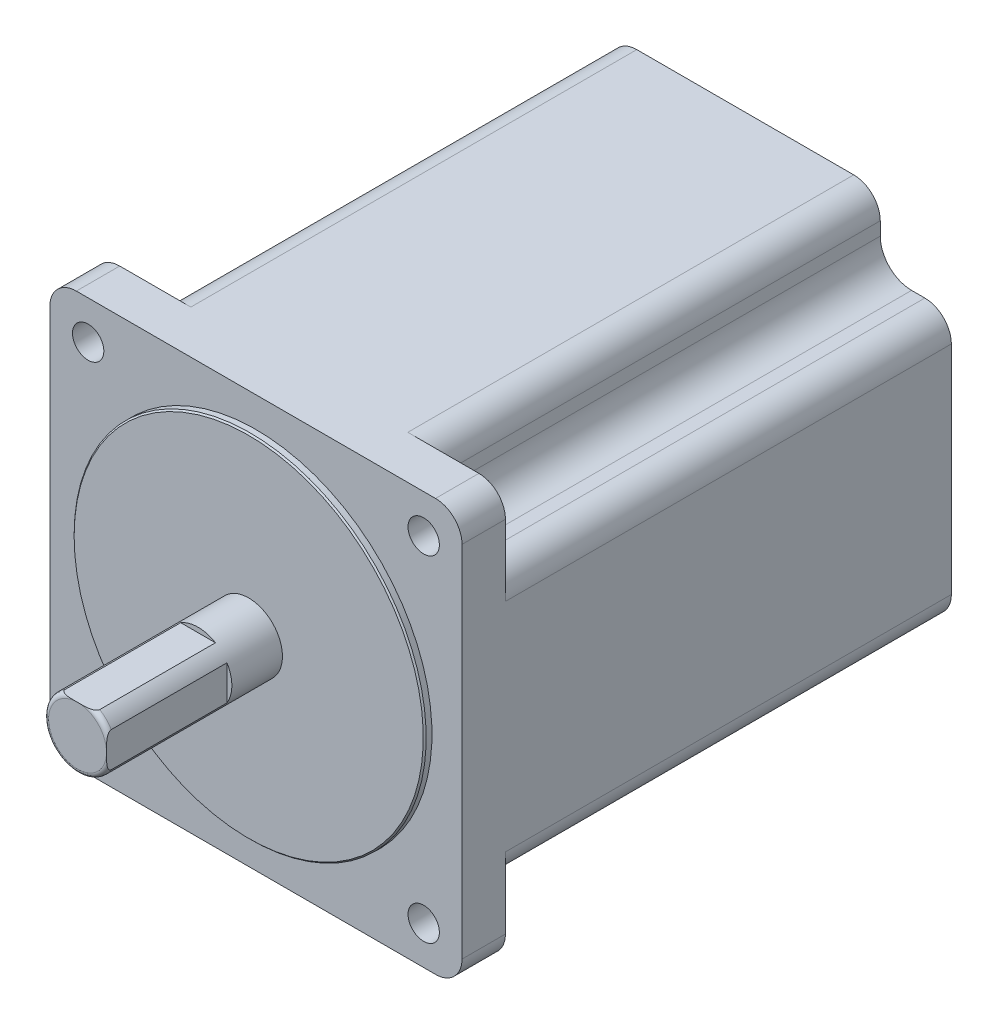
ISO-10303-21;
HEADER;
FILE_DESCRIPTION(('STEP AP214'),'2;1');
FILE_NAME('part.step','',(''),(''),'','','');
FILE_SCHEMA(('AUTOMOTIVE_DESIGN { 1 0 10303 214 1 1 1 1 }'));
ENDSEC;
DATA;
#1=APPLICATION_CONTEXT('core data for automotive mechanical design processes');
#2=APPLICATION_PROTOCOL_DEFINITION('international standard','automotive_design',2000,#1);
#3=PRODUCT_CONTEXT('',#1,'mechanical');
#4=PRODUCT('Part','Part','',(#3));
#5=PRODUCT_RELATED_PRODUCT_CATEGORY('part','',(#4));
#6=PRODUCT_DEFINITION_FORMATION('','',#4);
#7=PRODUCT_DEFINITION_CONTEXT('part definition',#1,'design');
#8=PRODUCT_DEFINITION('design','',#6,#7);
#9=PRODUCT_DEFINITION_SHAPE('','',#8);
#10=(LENGTH_UNIT() NAMED_UNIT(*) SI_UNIT(.MILLI.,.METRE.));
#11=(NAMED_UNIT(*) PLANE_ANGLE_UNIT() SI_UNIT($,.RADIAN.));
#12=(NAMED_UNIT(*) SI_UNIT($,.STERADIAN.) SOLID_ANGLE_UNIT());
#13=UNCERTAINTY_MEASURE_WITH_UNIT(LENGTH_MEASURE(1.E-05),#10,'distance_accuracy_value','');
#14=(GEOMETRIC_REPRESENTATION_CONTEXT(3) GLOBAL_UNCERTAINTY_ASSIGNED_CONTEXT((#13)) GLOBAL_UNIT_ASSIGNED_CONTEXT((#10,
#11,#12)) REPRESENTATION_CONTEXT('',''));
#15=CARTESIAN_POINT('',(0.,0.,0.));
#16=DIRECTION('',(0.,0.,1.));
#17=DIRECTION('',(1.,0.,0.));
#18=AXIS2_PLACEMENT_3D('',#15,#16,#17);
#19=CARTESIAN_POINT('',(0.,0.,35.5));
#20=DIRECTION('',(0.,0.,-1.));
#21=DIRECTION('',(-1.,0.,0.));
#22=AXIS2_PLACEMENT_3D('',#19,#20,#21);
#23=CYLINDRICAL_SURFACE('',#22,7.);
#24=CARTESIAN_POINT('',(0.,0.,0.));
#25=DIRECTION('',(0.,0.,-1.));
#26=DIRECTION('',(-1.,0.,0.));
#27=AXIS2_PLACEMENT_3D('',#24,#25,#26);
#28=CIRCLE('',#27,7.);
#29=CARTESIAN_POINT('',(-7.,0.,0.));
#30=VERTEX_POINT('',#29);
#31=EDGE_CURVE('E866',#30,#30,#28,.T.);
#32=ORIENTED_EDGE('',*,*,#31,.F.);
#33=EDGE_LOOP('',(#32));
#34=FACE_BOUND('',#33,.T.);
#35=CARTESIAN_POINT('',(0.,0.,34.5));
#36=DIRECTION('',(0.,0.,1.));
#37=DIRECTION('',(1.,0.,0.));
#38=AXIS2_PLACEMENT_3D('',#35,#36,#37);
#39=CIRCLE('',#38,7.);
#40=CARTESIAN_POINT('',(6.,-3.60555127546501,34.4999999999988));
#41=VERTEX_POINT('',#40);
#42=CARTESIAN_POINT('',(-3.60555127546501,6.,34.4999999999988));
#43=VERTEX_POINT('',#42);
#44=EDGE_CURVE('E327',#41,#43,#39,.F.);
#45=ORIENTED_EDGE('',*,*,#44,.T.);
#46=DIRECTION('',(0.,0.,-1.));
#47=VECTOR('',#46,1.);
#48=CARTESIAN_POINT('',(-3.60555127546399,6.,35.5));
#49=LINE('',#48,#47);
#50=CARTESIAN_POINT('',(-3.60555127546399,6.,10.5));
#51=VERTEX_POINT('',#50);
#52=EDGE_CURVE('E1400',#43,#51,#49,.T.);
#53=ORIENTED_EDGE('',*,*,#52,.T.);
#54=CARTESIAN_POINT('',(0.,0.,10.5));
#55=DIRECTION('',(0.,0.,1.));
#56=DIRECTION('',(1.,0.,0.));
#57=AXIS2_PLACEMENT_3D('',#54,#55,#56);
#58=CIRCLE('',#57,7.);
#59=CARTESIAN_POINT('',(3.60555127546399,6.,10.5));
#60=VERTEX_POINT('',#59);
#61=EDGE_CURVE('E1424',#60,#51,#58,.T.);
#62=ORIENTED_EDGE('',*,*,#61,.F.);
#63=DIRECTION('',(0.,0.,-1.));
#64=VECTOR('',#63,1.);
#65=CARTESIAN_POINT('',(3.60555127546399,6.,35.5));
#66=LINE('',#65,#64);
#67=CARTESIAN_POINT('',(3.60555127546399,6.,34.5));
#68=VERTEX_POINT('',#67);
#69=EDGE_CURVE('E1397',#60,#68,#66,.F.);
#70=ORIENTED_EDGE('',*,*,#69,.T.);
#71=CARTESIAN_POINT('',(6.,3.60555127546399,34.5));
#72=VERTEX_POINT('',#71);
#73=EDGE_CURVE('E344',#68,#72,#39,.F.);
#74=ORIENTED_EDGE('',*,*,#73,.T.);
#75=DIRECTION('',(0.,0.,-1.));
#76=VECTOR('',#75,1.);
#77=CARTESIAN_POINT('',(6.,3.60555127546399,35.5));
#78=LINE('',#77,#76);
#79=CARTESIAN_POINT('',(6.,3.60555127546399,10.5));
#80=VERTEX_POINT('',#79);
#81=EDGE_CURVE('E62',#80,#72,#78,.F.);
#82=ORIENTED_EDGE('',*,*,#81,.F.);
#83=CARTESIAN_POINT('',(6.,-3.60555127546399,10.5));
#84=VERTEX_POINT('',#83);
#85=EDGE_CURVE('E1426',#84,#80,#58,.T.);
#86=ORIENTED_EDGE('',*,*,#85,.F.);
#87=DIRECTION('',(0.,0.,-1.));
#88=VECTOR('',#87,1.);
#89=CARTESIAN_POINT('',(6.,-3.60555127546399,35.5));
#90=LINE('',#89,#88);
#91=EDGE_CURVE('E1395',#41,#84,#90,.T.);
#92=ORIENTED_EDGE('',*,*,#91,.F.);
#93=EDGE_LOOP('',(#45,#53,#62,#70,#74,#82,#86,#92));
#94=FACE_BOUND('',#93,.T.);
#95=ADVANCED_FACE('F39',(#34,#94),#23,.T.);
#96=CARTESIAN_POINT('',(0.,0.,34.5));
#97=DIRECTION('',(0.,0.,1.));
#98=DIRECTION('',(1.,0.,0.));
#99=AXIS2_PLACEMENT_3D('',#96,#97,#98);
#100=TOROIDAL_SURFACE('',#99,6.,1.);
#101=CARTESIAN_POINT('',(-3.60310285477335,6.,34.4498));
#102=CARTESIAN_POINT('',(-3.60606903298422,6.,34.4794230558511));
#103=CARTESIAN_POINT('',(-3.60634334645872,6.,34.5092692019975));
#104=CARTESIAN_POINT('',(-3.60183180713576,6.,34.5683743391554));
#105=CARTESIAN_POINT('',(-3.5970811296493,6.,34.5976359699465));
#106=CARTESIAN_POINT('',(-3.58288474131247,6.,34.6549369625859));
#107=CARTESIAN_POINT('',(-3.57344503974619,6.,34.6829778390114));
#108=CARTESIAN_POINT('',(-3.55053706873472,6.,34.7373798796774));
#109=CARTESIAN_POINT('',(-3.53706251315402,6.,34.7637383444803));
#110=CARTESIAN_POINT('',(-3.49911909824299,6.,34.8273406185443));
#111=CARTESIAN_POINT('',(-3.47254030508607,6.,34.8633245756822));
#112=CARTESIAN_POINT('',(-3.41403959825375,6.,34.930664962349));
#113=CARTESIAN_POINT('',(-3.38210229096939,6.,34.9620075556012));
#114=CARTESIAN_POINT('',(-3.29347227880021,6.,35.0386085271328));
#115=CARTESIAN_POINT('',(-3.23376530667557,6.,35.0803505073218));
#116=CARTESIAN_POINT('',(-3.10904816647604,6.,35.1545976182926));
#117=CARTESIAN_POINT('',(-3.04403268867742,6.,35.18709335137));
#118=CARTESIAN_POINT('',(-2.91093070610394,6.,35.2447829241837));
#119=CARTESIAN_POINT('',(-2.84284537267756,6.,35.269979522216));
#120=CARTESIAN_POINT('',(-2.70477563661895,6.,35.3145991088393));
#121=CARTESIAN_POINT('',(-2.6347892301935,6.,35.3340157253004));
#122=CARTESIAN_POINT('',(-2.4933113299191,6.,35.3683088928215));
#123=CARTESIAN_POINT('',(-2.42181350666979,6.,35.3831587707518));
#124=CARTESIAN_POINT('',(-2.27821414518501,6.,35.4090924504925));
#125=CARTESIAN_POINT('',(-2.20611314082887,6.,35.4201792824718));
#126=CARTESIAN_POINT('',(-2.0472037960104,6.,35.4412630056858));
#127=CARTESIAN_POINT('',(-1.96031085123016,6.,35.4506091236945));
#128=CARTESIAN_POINT('',(-1.78623141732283,6.,35.4660708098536));
#129=CARTESIAN_POINT('',(-1.69904486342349,6.,35.4721856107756));
#130=CARTESIAN_POINT('',(-1.52445988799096,6.,35.4820458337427));
#131=CARTESIAN_POINT('',(-1.43706134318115,6.,35.4857889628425));
#132=CARTESIAN_POINT('',(-1.26220665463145,6.,35.4916073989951));
#133=CARTESIAN_POINT('',(-1.17475050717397,6.,35.4936825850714));
#134=CARTESIAN_POINT('',(-0.999487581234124,6.,35.4967511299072));
#135=CARTESIAN_POINT('',(-0.911680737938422,6.,35.4977403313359));
#136=CARTESIAN_POINT('',(-0.736061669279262,6.,35.4990875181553));
#137=CARTESIAN_POINT('',(-0.648249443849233,6.,35.4994454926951));
#138=CARTESIAN_POINT('',(-0.472684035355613,6.,35.4998721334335));
#139=CARTESIAN_POINT('',(-0.384930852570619,6.,35.4999409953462));
#140=CARTESIAN_POINT('',(-0.209424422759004,6.,35.5000049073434));
#141=CARTESIAN_POINT('',(-0.121671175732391,6.,35.4999999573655));
#142=CARTESIAN_POINT('',(0.0534958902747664,6.,35.5000000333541));
#143=CARTESIAN_POINT('',(0.140909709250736,6.,35.5000050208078));
#144=CARTESIAN_POINT('',(0.31573730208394,6.,35.4999761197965));
#145=CARTESIAN_POINT('',(0.40315107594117,6.,35.499942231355));
#146=CARTESIAN_POINT('',(0.578031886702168,6.,35.4996567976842));
#147=CARTESIAN_POINT('',(0.66549892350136,6.,35.4994051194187));
#148=CARTESIAN_POINT('',(0.840429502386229,6.,35.4983788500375));
#149=CARTESIAN_POINT('',(0.927893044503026,6.,35.4976042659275));
#150=CARTESIAN_POINT('',(1.10251222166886,6.,35.4951097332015));
#151=CARTESIAN_POINT('',(1.18966789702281,6.,35.4933929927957));
#152=CARTESIAN_POINT('',(1.36393564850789,6.,35.4884754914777));
#153=CARTESIAN_POINT('',(1.4510477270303,6.,35.4852748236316));
#154=CARTESIAN_POINT('',(1.62510052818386,6.,35.4767270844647));
#155=CARTESIAN_POINT('',(1.71204133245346,6.,35.471381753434));
#156=CARTESIAN_POINT('',(1.8856863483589,6.,35.4577415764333));
#157=CARTESIAN_POINT('',(1.97239060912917,6.,35.4494473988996));
#158=CARTESIAN_POINT('',(2.10407408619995,6.,35.433817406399));
#159=CARTESIAN_POINT('',(2.14922335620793,6.,35.4279124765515));
#160=CARTESIAN_POINT('',(2.23935687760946,6.,35.4148544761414));
#161=CARTESIAN_POINT('',(2.28434107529,6.,35.4077010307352));
#162=CARTESIAN_POINT('',(2.37424904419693,6.,35.3919272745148));
#163=CARTESIAN_POINT('',(2.41917176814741,6.,35.3833009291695));
#164=CARTESIAN_POINT('',(2.50866395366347,6.,35.3643855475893));
#165=CARTESIAN_POINT('',(2.55323343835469,6.,35.3540966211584));
#166=CARTESIAN_POINT('',(2.65933979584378,6.,35.3271831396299));
#167=CARTESIAN_POINT('',(2.72065381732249,6.,35.309658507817));
#168=CARTESIAN_POINT('',(2.84189365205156,6.,35.2700713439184));
#169=CARTESIAN_POINT('',(2.9018180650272,6.,35.2480044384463));
#170=CARTESIAN_POINT('',(3.01892944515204,6.,35.1985144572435));
#171=CARTESIAN_POINT('',(3.07613337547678,6.,35.171132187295));
#172=CARTESIAN_POINT('',(3.1867963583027,6.,35.1097235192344));
#173=CARTESIAN_POINT('',(3.2402649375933,6.,35.0757149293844));
#174=CARTESIAN_POINT('',(3.32212583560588,6.,35.0139772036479));
#175=CARTESIAN_POINT('',(3.35237087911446,6.,34.988716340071));
#176=CARTESIAN_POINT('',(3.4096487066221,6.,34.9346946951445));
#177=CARTESIAN_POINT('',(3.43667963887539,6.,34.905931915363));
#178=CARTESIAN_POINT('',(3.48654628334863,6.,34.8443922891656));
#179=CARTESIAN_POINT('',(3.50933353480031,6.,34.8115754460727));
#180=CARTESIAN_POINT('',(3.54866231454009,6.,34.7423666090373));
#181=CARTESIAN_POINT('',(3.56521573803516,6.,34.7059815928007));
#182=CARTESIAN_POINT('',(3.58720258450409,6.,34.6400371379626));
#183=CARTESIAN_POINT('',(3.59438512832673,6.,34.6110603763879));
#184=CARTESIAN_POINT('',(3.60372793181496,6.,34.5523411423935));
#185=CARTESIAN_POINT('',(3.60589903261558,6.,34.5226004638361));
#186=CARTESIAN_POINT('',(3.60531020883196,6.,34.478514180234));
#187=CARTESIAN_POINT('',(3.60451304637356,6.,34.464123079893));
#188=CARTESIAN_POINT('',(3.60310285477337,6.,34.4498000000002));
#189=B_SPLINE_CURVE_WITH_KNOTS('',3,(#101,#102,#103,#104,#105,#106,#107,#108,#109,#110,#111,
#112,#113,#114,#115,#116,#117,#118,#119,#120,#121,#122,#123,#124,#125,#126,#127,#128,#129,#130,
#131,#132,#133,#134,#135,#136,#137,#138,#139,#140,#141,#142,#143,#144,#145,#146,#147,#148,#149,
#150,#151,#152,#153,#154,#155,#156,#157,#158,#159,#160,#161,#162,#163,#164,#165,#166,#167,#168,
#169,#170,#171,#172,#173,#174,#175,#176,#177,#178,#179,#180,#181,#182,#183,#184,#185,#186,#187,
#188),.UNSPECIFIED.,.F.,.F.,(4,2,2,2,2,2,2,2,2,2,2,2,2,2,2,2,2,2,2,2,2,2,2,2,2,2,2,2,2,2,2,2,2,
2,2,2,2,2,2,2,2,2,2,4),(0.,0.0891302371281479,0.177640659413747,0.266037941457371,
0.354573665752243,0.488015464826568,0.621847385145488,0.839168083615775,1.05670887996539,
1.27416736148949,1.49186469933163,1.71081040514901,1.92957938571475,2.19167726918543,
2.45383735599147,2.71625051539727,2.97868270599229,3.24211606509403,3.50555395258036,
3.76881347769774,4.03207322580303,4.29431468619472,4.55655598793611,4.8189575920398,
5.08135568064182,5.34286575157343,5.60435942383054,5.86564133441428,6.1268640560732,
6.26345130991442,6.40007964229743,6.5372818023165,6.67447490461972,6.86564045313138,
7.05699092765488,7.24692669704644,7.43635888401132,7.55435538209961,7.67241953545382,
7.79175876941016,7.91086911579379,8.00004527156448,8.08902833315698,8.13221435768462),.UNSPECIFIED.);
#190=CARTESIAN_POINT('',(0.,6.,35.5));
#191=VERTEX_POINT('',#190);
#192=EDGE_CURVE('E54',#43,#191,#189,.T.);
#193=ORIENTED_EDGE('',*,*,#192,.F.);
#194=ORIENTED_EDGE('',*,*,#44,.F.);
#195=CARTESIAN_POINT('',(6.,-3.60310285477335,34.4498));
#196=CARTESIAN_POINT('',(6.,-3.60606903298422,34.4794230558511));
#197=CARTESIAN_POINT('',(6.,-3.60634334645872,34.5092692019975));
#198=CARTESIAN_POINT('',(6.,-3.60183180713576,34.5683743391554));
#199=CARTESIAN_POINT('',(6.,-3.5970811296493,34.5976359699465));
#200=CARTESIAN_POINT('',(6.,-3.58288474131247,34.6549369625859));
#201=CARTESIAN_POINT('',(6.,-3.57344503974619,34.6829778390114));
#202=CARTESIAN_POINT('',(6.,-3.55053706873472,34.7373798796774));
#203=CARTESIAN_POINT('',(6.,-3.53706251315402,34.7637383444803));
#204=CARTESIAN_POINT('',(6.,-3.49911909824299,34.8273406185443));
#205=CARTESIAN_POINT('',(6.,-3.47254030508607,34.8633245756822));
#206=CARTESIAN_POINT('',(6.,-3.41403959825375,34.930664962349));
#207=CARTESIAN_POINT('',(6.,-3.38210229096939,34.9620075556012));
#208=CARTESIAN_POINT('',(6.,-3.29347227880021,35.0386085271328));
#209=CARTESIAN_POINT('',(6.,-3.23376530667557,35.0803505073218));
#210=CARTESIAN_POINT('',(6.,-3.10904816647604,35.1545976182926));
#211=CARTESIAN_POINT('',(6.,-3.04403268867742,35.18709335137));
#212=CARTESIAN_POINT('',(6.,-2.91093070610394,35.2447829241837));
#213=CARTESIAN_POINT('',(6.,-2.84284537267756,35.269979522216));
#214=CARTESIAN_POINT('',(6.,-2.70477563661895,35.3145991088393));
#215=CARTESIAN_POINT('',(6.,-2.6347892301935,35.3340157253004));
#216=CARTESIAN_POINT('',(6.,-2.4933113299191,35.3683088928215));
#217=CARTESIAN_POINT('',(6.,-2.42181350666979,35.3831587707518));
#218=CARTESIAN_POINT('',(6.,-2.27821414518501,35.4090924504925));
#219=CARTESIAN_POINT('',(6.,-2.20611314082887,35.4201792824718));
#220=CARTESIAN_POINT('',(6.,-2.0472037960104,35.4412630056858));
#221=CARTESIAN_POINT('',(6.,-1.96031085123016,35.4506091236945));
#222=CARTESIAN_POINT('',(6.,-1.78623141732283,35.4660708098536));
#223=CARTESIAN_POINT('',(6.,-1.69904486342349,35.4721856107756));
#224=CARTESIAN_POINT('',(6.,-1.52445988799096,35.4820458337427));
#225=CARTESIAN_POINT('',(6.,-1.43706134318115,35.4857889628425));
#226=CARTESIAN_POINT('',(6.,-1.26220665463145,35.4916073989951));
#227=CARTESIAN_POINT('',(6.,-1.17475050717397,35.4936825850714));
#228=CARTESIAN_POINT('',(6.,-0.999487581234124,35.4967511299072));
#229=CARTESIAN_POINT('',(6.,-0.911680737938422,35.4977403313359));
#230=CARTESIAN_POINT('',(6.,-0.736061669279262,35.4990875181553));
#231=CARTESIAN_POINT('',(6.,-0.648249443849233,35.4994454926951));
#232=CARTESIAN_POINT('',(6.,-0.472684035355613,35.4998721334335));
#233=CARTESIAN_POINT('',(6.,-0.384930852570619,35.4999409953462));
#234=CARTESIAN_POINT('',(6.,-0.209424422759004,35.5000049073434));
#235=CARTESIAN_POINT('',(6.,-0.121671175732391,35.4999999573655));
#236=CARTESIAN_POINT('',(6.,0.0534958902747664,35.5000000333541));
#237=CARTESIAN_POINT('',(6.,0.140909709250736,35.5000050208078));
#238=CARTESIAN_POINT('',(6.,0.31573730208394,35.4999761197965));
#239=CARTESIAN_POINT('',(6.,0.40315107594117,35.499942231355));
#240=CARTESIAN_POINT('',(6.,0.578031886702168,35.4996567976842));
#241=CARTESIAN_POINT('',(6.,0.66549892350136,35.4994051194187));
#242=CARTESIAN_POINT('',(6.,0.840429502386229,35.4983788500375));
#243=CARTESIAN_POINT('',(6.,0.927893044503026,35.4976042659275));
#244=CARTESIAN_POINT('',(6.,1.10251222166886,35.4951097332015));
#245=CARTESIAN_POINT('',(6.,1.18966789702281,35.4933929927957));
#246=CARTESIAN_POINT('',(6.,1.36393564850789,35.4884754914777));
#247=CARTESIAN_POINT('',(6.,1.4510477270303,35.4852748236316));
#248=CARTESIAN_POINT('',(6.,1.62510052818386,35.4767270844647));
#249=CARTESIAN_POINT('',(6.,1.71204133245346,35.471381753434));
#250=CARTESIAN_POINT('',(6.,1.8856863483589,35.4577415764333));
#251=CARTESIAN_POINT('',(6.,1.97239060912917,35.4494473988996));
#252=CARTESIAN_POINT('',(6.,2.10407408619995,35.433817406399));
#253=CARTESIAN_POINT('',(6.,2.14922335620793,35.4279124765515));
#254=CARTESIAN_POINT('',(6.,2.23935687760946,35.4148544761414));
#255=CARTESIAN_POINT('',(6.,2.28434107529,35.4077010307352));
#256=CARTESIAN_POINT('',(6.,2.37424904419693,35.3919272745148));
#257=CARTESIAN_POINT('',(6.,2.41917176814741,35.3833009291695));
#258=CARTESIAN_POINT('',(6.,2.50866395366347,35.3643855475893));
#259=CARTESIAN_POINT('',(6.,2.55323343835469,35.3540966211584));
#260=CARTESIAN_POINT('',(6.,2.65933979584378,35.3271831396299));
#261=CARTESIAN_POINT('',(6.,2.72065381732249,35.309658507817));
#262=CARTESIAN_POINT('',(6.,2.84189365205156,35.2700713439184));
#263=CARTESIAN_POINT('',(6.,2.9018180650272,35.2480044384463));
#264=CARTESIAN_POINT('',(6.,3.01892944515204,35.1985144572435));
#265=CARTESIAN_POINT('',(6.,3.07613337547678,35.171132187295));
#266=CARTESIAN_POINT('',(6.,3.1867963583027,35.1097235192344));
#267=CARTESIAN_POINT('',(6.,3.2402649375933,35.0757149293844));
#268=CARTESIAN_POINT('',(6.,3.32212583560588,35.0139772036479));
#269=CARTESIAN_POINT('',(6.,3.35237087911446,34.988716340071));
#270=CARTESIAN_POINT('',(6.,3.4096487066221,34.9346946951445));
#271=CARTESIAN_POINT('',(6.,3.43667963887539,34.905931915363));
#272=CARTESIAN_POINT('',(6.,3.48654628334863,34.8443922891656));
#273=CARTESIAN_POINT('',(6.,3.50933353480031,34.8115754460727));
#274=CARTESIAN_POINT('',(6.,3.54866231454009,34.7423666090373));
#275=CARTESIAN_POINT('',(6.,3.56521573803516,34.7059815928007));
#276=CARTESIAN_POINT('',(6.,3.58720258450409,34.6400371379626));
#277=CARTESIAN_POINT('',(6.,3.59438512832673,34.6110603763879));
#278=CARTESIAN_POINT('',(6.,3.60372793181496,34.5523411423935));
#279=CARTESIAN_POINT('',(6.,3.60589903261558,34.5226004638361));
#280=CARTESIAN_POINT('',(6.,3.60531020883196,34.478514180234));
#281=CARTESIAN_POINT('',(6.,3.60451304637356,34.464123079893));
#282=CARTESIAN_POINT('',(6.,3.60310285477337,34.4498000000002));
#283=B_SPLINE_CURVE_WITH_KNOTS('',3,(#195,#196,#197,#198,#199,#200,#201,#202,#203,#204,#205,
#206,#207,#208,#209,#210,#211,#212,#213,#214,#215,#216,#217,#218,#219,#220,#221,#222,#223,#224,
#225,#226,#227,#228,#229,#230,#231,#232,#233,#234,#235,#236,#237,#238,#239,#240,#241,#242,#243,
#244,#245,#246,#247,#248,#249,#250,#251,#252,#253,#254,#255,#256,#257,#258,#259,#260,#261,#262,
#263,#264,#265,#266,#267,#268,#269,#270,#271,#272,#273,#274,#275,#276,#277,#278,#279,#280,#281,
#282),.UNSPECIFIED.,.F.,.F.,(4,2,2,2,2,2,2,2,2,2,2,2,2,2,2,2,2,2,2,2,2,2,2,2,2,2,2,2,2,2,2,2,2,
2,2,2,2,2,2,2,2,2,2,4),(0.,0.0891302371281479,0.177640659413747,0.266037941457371,
0.354573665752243,0.488015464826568,0.621847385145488,0.839168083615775,1.05670887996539,
1.27416736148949,1.49186469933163,1.71081040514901,1.92957938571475,2.19167726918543,
2.45383735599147,2.71625051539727,2.97868270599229,3.24211606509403,3.50555395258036,
3.76881347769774,4.03207322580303,4.29431468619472,4.55655598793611,4.8189575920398,
5.08135568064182,5.34286575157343,5.60435942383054,5.86564133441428,6.1268640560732,
6.26345130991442,6.40007964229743,6.5372818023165,6.67447490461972,6.86564045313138,
7.05699092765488,7.24692669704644,7.43635888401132,7.55435538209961,7.67241953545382,
7.79175876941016,7.91086911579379,8.00004527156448,8.08902833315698,8.13221435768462),.UNSPECIFIED.);
#284=CARTESIAN_POINT('',(6.,-4.63767449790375E-07,35.5));
#285=VERTEX_POINT('',#284);
#286=EDGE_CURVE('E321',#41,#285,#283,.T.);
#287=ORIENTED_EDGE('',*,*,#286,.T.);
#288=CARTESIAN_POINT('',(0.,0.,35.5));
#289=DIRECTION('',(0.,0.,1.));
#290=DIRECTION('',(1.,0.,0.));
#291=AXIS2_PLACEMENT_3D('',#288,#289,#290);
#292=CIRCLE('',#291,6.);
#293=EDGE_CURVE('E334',#191,#285,#292,.T.);
#294=ORIENTED_EDGE('',*,*,#293,.F.);
#295=EDGE_LOOP('',(#193,#194,#287,#294));
#296=FACE_BOUND('',#295,.T.);
#297=ADVANCED_FACE('F333',(#296),#100,.T.);
#298=EDGE_CURVE('E337',#191,#68,#189,.T.);
#299=ORIENTED_EDGE('',*,*,#298,.F.);
#300=EDGE_CURVE('E340',#285,#191,#292,.T.);
#301=ORIENTED_EDGE('',*,*,#300,.F.);
#302=EDGE_CURVE('E318',#285,#72,#283,.T.);
#303=ORIENTED_EDGE('',*,*,#302,.T.);
#304=ORIENTED_EDGE('',*,*,#73,.F.);
#305=EDGE_LOOP('',(#299,#301,#303,#304));
#306=FACE_BOUND('',#305,.T.);
#307=ADVANCED_FACE('F343',(#306),#100,.T.);
#308=CARTESIAN_POINT('',(13.25,-54.75,-103.));
#309=DIRECTION('',(-1.,0.,0.));
#310=DIRECTION('',(0.,0.,1.));
#311=AXIS2_PLACEMENT_3D('',#308,#309,#310);
#312=PLANE('',#311);
#313=DIRECTION('',(0.,0.,1.));
#314=VECTOR('',#313,1.);
#315=CARTESIAN_POINT('',(13.25,-49.75,-103.));
#316=LINE('',#315,#314);
#317=CARTESIAN_POINT('',(13.25,-49.75,-100.542857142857));
#318=VERTEX_POINT('',#317);
#319=CARTESIAN_POINT('',(13.25,-49.75,-82.));
#320=VERTEX_POINT('',#319);
#321=EDGE_CURVE('E658',#318,#320,#316,.T.);
#322=ORIENTED_EDGE('',*,*,#321,.F.);
#323=DIRECTION('',(0.,0.631271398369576,-0.775562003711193));
#324=VECTOR('',#323,1.);
#325=CARTESIAN_POINT('',(13.25,-50.5395250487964,-99.5728692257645));
#326=LINE('',#325,#324);
#327=CARTESIAN_POINT('',(13.25,-47.75,-103.));
#328=VERTEX_POINT('',#327);
#329=EDGE_CURVE('E664',#318,#328,#326,.T.);
#330=ORIENTED_EDGE('',*,*,#329,.T.);
#331=DIRECTION('',(0.,1.,0.));
#332=VECTOR('',#331,1.);
#333=CARTESIAN_POINT('',(13.25,-54.75,-103.));
#334=LINE('',#333,#332);
#335=CARTESIAN_POINT('',(13.25,-42.75,-103.));
#336=VERTEX_POINT('',#335);
#337=EDGE_CURVE('E693',#328,#336,#334,.T.);
#338=ORIENTED_EDGE('',*,*,#337,.T.);
#339=DIRECTION('',(0.,0.,1.));
#340=VECTOR('',#339,1.);
#341=CARTESIAN_POINT('',(13.25,-42.75,-103.));
#342=LINE('',#341,#340);
#343=CARTESIAN_POINT('',(13.25,-42.75,-82.));
#344=VERTEX_POINT('',#343);
#345=EDGE_CURVE('E687',#336,#344,#342,.T.);
#346=ORIENTED_EDGE('',*,*,#345,.T.);
#347=DIRECTION('',(0.,1.,0.));
#348=VECTOR('',#347,1.);
#349=CARTESIAN_POINT('',(13.25,-54.75,-82.));
#350=LINE('',#349,#348);
#351=EDGE_CURVE('E667',#320,#344,#350,.T.);
#352=ORIENTED_EDGE('',*,*,#351,.F.);
#353=EDGE_LOOP('',(#322,#330,#338,#346,#352));
#354=FACE_BOUND('',#353,.T.);
#355=ADVANCED_FACE('F389',(#354),#312,.F.);
#356=CARTESIAN_POINT('',(-13.25,-54.75,-82.));
#357=DIRECTION('',(0.,0.,-1.));
#358=DIRECTION('',(-1.,0.,0.));
#359=AXIS2_PLACEMENT_3D('',#356,#357,#358);
#360=PLANE('',#359);
#361=DIRECTION('',(0.754605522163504,0.656178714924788,0.));
#362=VECTOR('',#361,1.);
#363=CARTESIAN_POINT('',(30.3390742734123,-34.8899354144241,-82.));
#364=LINE('',#363,#362);
#365=CARTESIAN_POINT('',(7.50000000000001,-54.75,-82.));
#366=VERTEX_POINT('',#365);
#367=EDGE_CURVE('E1403',#366,#320,#364,.T.);
#368=ORIENTED_EDGE('',*,*,#367,.T.);
#369=ORIENTED_EDGE('',*,*,#351,.T.);
#370=DIRECTION('',(-1.,0.,0.));
#371=VECTOR('',#370,1.);
#372=CARTESIAN_POINT('',(-13.25,-42.75,-82.));
#373=LINE('',#372,#371);
#374=CARTESIAN_POINT('',(-13.25,-42.75,-82.));
#375=VERTEX_POINT('',#374);
#376=EDGE_CURVE('E684',#344,#375,#373,.T.);
#377=ORIENTED_EDGE('',*,*,#376,.T.);
#378=DIRECTION('',(0.,1.,0.));
#379=VECTOR('',#378,1.);
#380=CARTESIAN_POINT('',(-13.25,-54.75,-82.));
#381=LINE('',#380,#379);
#382=CARTESIAN_POINT('',(-13.25,-49.75,-82.));
#383=VERTEX_POINT('',#382);
#384=EDGE_CURVE('E683',#383,#375,#381,.T.);
#385=ORIENTED_EDGE('',*,*,#384,.F.);
#386=DIRECTION('',(-0.754605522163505,0.656178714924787,0.));
#387=VECTOR('',#386,1.);
#388=CARTESIAN_POINT('',(-30.3390742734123,-34.8899354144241,-82.));
#389=LINE('',#388,#387);
#390=CARTESIAN_POINT('',(-7.49999999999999,-54.75,-82.));
#391=VERTEX_POINT('',#390);
#392=EDGE_CURVE('E668',#391,#383,#389,.T.);
#393=ORIENTED_EDGE('',*,*,#392,.F.);
#394=DIRECTION('',(-1.,0.,0.));
#395=VECTOR('',#394,1.);
#396=CARTESIAN_POINT('',(-13.25,-54.75,-82.));
#397=LINE('',#396,#395);
#398=EDGE_CURVE('E681',#366,#391,#397,.T.);
#399=ORIENTED_EDGE('',*,*,#398,.F.);
#400=EDGE_LOOP('',(#368,#369,#377,#385,#393,#399));
#401=FACE_BOUND('',#400,.T.);
#402=ADVANCED_FACE('F385',(#401),#360,.F.);
#403=CARTESIAN_POINT('',(0.,-54.75,0.));
#404=DIRECTION('',(0.,1.,0.));
#405=DIRECTION('',(0.,0.,1.));
#406=AXIS2_PLACEMENT_3D('',#403,#404,#405);
#407=PLANE('',#406);
#408=DIRECTION('',(0.,0.,1.));
#409=VECTOR('',#408,1.);
#410=CARTESIAN_POINT('',(7.50000000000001,-54.75,-103.));
#411=LINE('',#410,#409);
#412=CARTESIAN_POINT('',(7.50000000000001,-54.75,-94.4));
#413=VERTEX_POINT('',#412);
#414=EDGE_CURVE('E661',#413,#366,#411,.T.);
#415=ORIENTED_EDGE('',*,*,#414,.T.);
#416=ORIENTED_EDGE('',*,*,#398,.T.);
#417=DIRECTION('',(0.,0.,1.));
#418=VECTOR('',#417,1.);
#419=CARTESIAN_POINT('',(-7.49999999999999,-54.75,-103.));
#420=LINE('',#419,#418);
#421=CARTESIAN_POINT('',(-7.5,-54.75,-94.4));
#422=VERTEX_POINT('',#421);
#423=EDGE_CURVE('E1407',#422,#391,#420,.T.);
#424=ORIENTED_EDGE('',*,*,#423,.F.);
#425=DIRECTION('',(1.,0.,0.));
#426=VECTOR('',#425,1.);
#427=CARTESIAN_POINT('',(0.,-54.75,-94.4));
#428=LINE('',#427,#426);
#429=EDGE_CURVE('E650',#422,#413,#428,.T.);
#430=ORIENTED_EDGE('',*,*,#429,.T.);
#431=EDGE_LOOP('',(#415,#416,#424,#430));
#432=FACE_BOUND('',#431,.T.);
#433=ADVANCED_FACE('F381',(#432),#407,.F.);
#434=CARTESIAN_POINT('',(-42.75,-47.75,-103.));
#435=DIRECTION('',(0.,0.775562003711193,0.631271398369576));
#436=DIRECTION('',(0.,-0.631271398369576,0.775562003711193));
#437=AXIS2_PLACEMENT_3D('',#434,#435,#436);
#438=PLANE('',#437);
#439=DIRECTION('',(0.587477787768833,0.510850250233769,-0.627616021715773));
#440=VECTOR('',#439,1.);
#441=CARTESIAN_POINT('',(-4.57108781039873,-65.2465980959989,-81.5041794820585));
#442=LINE('',#441,#440);
#443=EDGE_CURVE('E341',#413,#318,#442,.T.);
#444=ORIENTED_EDGE('',*,*,#443,.F.);
#445=ORIENTED_EDGE('',*,*,#429,.F.);
#446=DIRECTION('',(-0.587477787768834,0.510850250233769,-0.627616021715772));
#447=VECTOR('',#446,1.);
#448=CARTESIAN_POINT('',(-24.937540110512,-39.5869216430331,-113.028924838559));
#449=LINE('',#448,#447);
#450=CARTESIAN_POINT('',(-13.25,-49.75,-100.542857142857));
#451=VERTEX_POINT('',#450);
#452=EDGE_CURVE('E652',#422,#451,#449,.T.);
#453=ORIENTED_EDGE('',*,*,#452,.T.);
#454=DIRECTION('',(0.,-0.631271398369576,0.775562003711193));
#455=VECTOR('',#454,1.);
#456=CARTESIAN_POINT('',(-13.25,-50.5395250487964,-99.5728692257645));
#457=LINE('',#456,#455);
#458=CARTESIAN_POINT('',(-13.25,-47.75,-103.));
#459=VERTEX_POINT('',#458);
#460=EDGE_CURVE('E673',#459,#451,#457,.T.);
#461=ORIENTED_EDGE('',*,*,#460,.F.);
#462=DIRECTION('',(1.,0.,0.));
#463=VECTOR('',#462,1.);
#464=CARTESIAN_POINT('',(-42.75,-47.75,-103.));
#465=LINE('',#464,#463);
#466=EDGE_CURVE('E671',#459,#328,#465,.T.);
#467=ORIENTED_EDGE('',*,*,#466,.T.);
#468=ORIENTED_EDGE('',*,*,#329,.F.);
#469=EDGE_LOOP('',(#444,#445,#453,#461,#467,#468));
#470=FACE_BOUND('',#469,.T.);
#471=ADVANCED_FACE('F377',(#470),#438,.F.);
#472=CARTESIAN_POINT('',(42.75,-42.75,-10.5));
#473=DIRECTION('',(0.,1.,0.));
#474=DIRECTION('',(0.,0.,1.));
#475=AXIS2_PLACEMENT_3D('',#472,#473,#474);
#476=PLANE('',#475);
#477=DIRECTION('',(0.,0.,-1.));
#478=VECTOR('',#477,1.);
#479=CARTESIAN_POINT('',(-13.25,-42.75,-103.));
#480=LINE('',#479,#478);
#481=CARTESIAN_POINT('',(-13.25,-42.75,-103.));
#482=VERTEX_POINT('',#481);
#483=EDGE_CURVE('E675',#375,#482,#480,.T.);
#484=ORIENTED_EDGE('',*,*,#483,.F.);
#485=ORIENTED_EDGE('',*,*,#376,.F.);
#486=ORIENTED_EDGE('',*,*,#345,.F.);
#487=DIRECTION('',(-1.,0.,0.));
#488=VECTOR('',#487,1.);
#489=CARTESIAN_POINT('',(0.,-42.75,-103.));
#490=LINE('',#489,#488);
#491=CARTESIAN_POINT('',(22.5,-42.75,-103.));
#492=VERTEX_POINT('',#491);
#493=EDGE_CURVE('E727',#492,#336,#490,.T.);
#494=ORIENTED_EDGE('',*,*,#493,.F.);
#495=DIRECTION('',(0.,0.,1.));
#496=VECTOR('',#495,1.);
#497=CARTESIAN_POINT('',(22.5,-42.75,-10.5));
#498=LINE('',#497,#496);
#499=CARTESIAN_POINT('',(22.5,-42.75,-10.5));
#500=VERTEX_POINT('',#499);
#501=EDGE_CURVE('E584',#492,#500,#498,.T.);
#502=ORIENTED_EDGE('',*,*,#501,.T.);
#503=DIRECTION('',(-1.,0.,0.));
#504=VECTOR('',#503,1.);
#505=CARTESIAN_POINT('',(42.75,-42.75,-10.5));
#506=LINE('',#505,#504);
#507=CARTESIAN_POINT('',(37.25,-42.75,-10.5));
#508=VERTEX_POINT('',#507);
#509=EDGE_CURVE('E843',#508,#500,#506,.T.);
#510=ORIENTED_EDGE('',*,*,#509,.F.);
#511=DIRECTION('',(0.,0.,1.));
#512=VECTOR('',#511,1.);
#513=CARTESIAN_POINT('',(37.25,-42.75,-10.5));
#514=LINE('',#513,#512);
#515=CARTESIAN_POINT('',(37.25,-42.75,-1.5));
#516=VERTEX_POINT('',#515);
#517=EDGE_CURVE('E878',#508,#516,#514,.T.);
#518=ORIENTED_EDGE('',*,*,#517,.T.);
#519=DIRECTION('',(-1.,0.,0.));
#520=VECTOR('',#519,1.);
#521=CARTESIAN_POINT('',(42.75,-42.75,-1.5));
#522=LINE('',#521,#520);
#523=CARTESIAN_POINT('',(-37.25,-42.75,-1.5));
#524=VERTEX_POINT('',#523);
#525=EDGE_CURVE('E874',#516,#524,#522,.T.);
#526=ORIENTED_EDGE('',*,*,#525,.T.);
#527=DIRECTION('',(0.,0.,1.));
#528=VECTOR('',#527,1.);
#529=CARTESIAN_POINT('',(-37.25,-42.75,-10.5));
#530=LINE('',#529,#528);
#531=CARTESIAN_POINT('',(-37.25,-42.75,-10.5));
#532=VERTEX_POINT('',#531);
#533=EDGE_CURVE('E871',#524,#532,#530,.F.);
#534=ORIENTED_EDGE('',*,*,#533,.T.);
#535=CARTESIAN_POINT('',(-22.5,-42.75,-10.5));
#536=VERTEX_POINT('',#535);
#537=EDGE_CURVE('E741',#536,#532,#506,.T.);
#538=ORIENTED_EDGE('',*,*,#537,.F.);
#539=DIRECTION('',(0.,0.,1.));
#540=VECTOR('',#539,1.);
#541=CARTESIAN_POINT('',(-22.5,-42.75,-103.));
#542=LINE('',#541,#540);
#543=CARTESIAN_POINT('',(-22.5,-42.75,-103.));
#544=VERTEX_POINT('',#543);
#545=EDGE_CURVE('E581',#536,#544,#542,.F.);
#546=ORIENTED_EDGE('',*,*,#545,.T.);
#547=EDGE_CURVE('E726',#482,#544,#490,.T.);
#548=ORIENTED_EDGE('',*,*,#547,.F.);
#549=EDGE_LOOP('',(#484,#485,#486,#494,#502,#510,#518,#526,#534,#538,#546,#548));
#550=FACE_BOUND('',#549,.T.);
#551=ADVANCED_FACE('F380',(#550),#476,.F.);
#552=CARTESIAN_POINT('',(-42.75,-42.75,-10.5));
#553=DIRECTION('',(0.,0.,-1.));
#554=DIRECTION('',(-1.,0.,0.));
#555=AXIS2_PLACEMENT_3D('',#552,#553,#554);
#556=PLANE('',#555);
#557=CARTESIAN_POINT('',(34.8,34.8,-10.5));
#558=DIRECTION('',(0.,0.,-1.));
#559=DIRECTION('',(-1.,0.,0.));
#560=AXIS2_PLACEMENT_3D('',#557,#558,#559);
#561=CIRCLE('',#560,3.25);
#562=CARTESIAN_POINT('',(31.55,34.8,-10.5));
#563=VERTEX_POINT('',#562);
#564=EDGE_CURVE('E932',#563,#563,#561,.T.);
#565=ORIENTED_EDGE('',*,*,#564,.F.);
#566=EDGE_LOOP('',(#565));
#567=FACE_BOUND('',#566,.T.);
#568=DIRECTION('',(0.,-1.,0.));
#569=VECTOR('',#568,1.);
#570=CARTESIAN_POINT('',(42.75,42.75,-10.5));
#571=LINE('',#570,#569);
#572=CARTESIAN_POINT('',(42.75,37.25,-10.5));
#573=VERTEX_POINT('',#572);
#574=CARTESIAN_POINT('',(42.75,22.5,-10.5));
#575=VERTEX_POINT('',#574);
#576=EDGE_CURVE('E777',#573,#575,#571,.T.);
#577=ORIENTED_EDGE('',*,*,#576,.T.);
#578=CARTESIAN_POINT('',(37.25,22.5,-10.5));
#579=DIRECTION('',(0.,0.,-1.));
#580=DIRECTION('',(-1.,0.,0.));
#581=AXIS2_PLACEMENT_3D('',#578,#579,#580);
#582=CIRCLE('',#581,5.5);
#583=CARTESIAN_POINT('',(37.25,28.,-10.5));
#584=VERTEX_POINT('',#583);
#585=EDGE_CURVE('E648',#575,#584,#582,.F.);
#586=ORIENTED_EDGE('',*,*,#585,.T.);
#587=DIRECTION('',(-1.,0.,0.));
#588=VECTOR('',#587,1.);
#589=CARTESIAN_POINT('',(0.,28.,-10.5));
#590=LINE('',#589,#588);
#591=CARTESIAN_POINT('',(34.5,28.,-10.5));
#592=VERTEX_POINT('',#591);
#593=EDGE_CURVE('E624',#584,#592,#590,.T.);
#594=ORIENTED_EDGE('',*,*,#593,.T.);
#595=CARTESIAN_POINT('',(34.5,34.5,-10.5));
#596=DIRECTION('',(0.,0.,-1.));
#597=DIRECTION('',(-1.,0.,0.));
#598=AXIS2_PLACEMENT_3D('',#595,#596,#597);
#599=CIRCLE('',#598,6.5);
#600=CARTESIAN_POINT('',(28.,34.5,-10.5));
#601=VERTEX_POINT('',#600);
#602=EDGE_CURVE('E816',#592,#601,#599,.T.);
#603=ORIENTED_EDGE('',*,*,#602,.T.);
#604=DIRECTION('',(0.,-1.,0.));
#605=VECTOR('',#604,1.);
#606=CARTESIAN_POINT('',(28.,0.,-10.5));
#607=LINE('',#606,#605);
#608=CARTESIAN_POINT('',(28.,37.25,-10.5));
#609=VERTEX_POINT('',#608);
#610=EDGE_CURVE('E611',#609,#601,#607,.T.);
#611=ORIENTED_EDGE('',*,*,#610,.F.);
#612=CARTESIAN_POINT('',(22.5,37.25,-10.5));
#613=DIRECTION('',(0.,0.,-1.));
#614=DIRECTION('',(-1.,0.,0.));
#615=AXIS2_PLACEMENT_3D('',#612,#613,#614);
#616=CIRCLE('',#615,5.5);
#617=CARTESIAN_POINT('',(22.5,42.75,-10.5));
#618=VERTEX_POINT('',#617);
#619=EDGE_CURVE('E645',#609,#618,#616,.F.);
#620=ORIENTED_EDGE('',*,*,#619,.T.);
#621=DIRECTION('',(1.,0.,0.));
#622=VECTOR('',#621,1.);
#623=CARTESIAN_POINT('',(42.75,42.75,-10.5));
#624=LINE('',#623,#622);
#625=CARTESIAN_POINT('',(37.25,42.75,-10.5));
#626=VERTEX_POINT('',#625);
#627=EDGE_CURVE('E761',#618,#626,#624,.T.);
#628=ORIENTED_EDGE('',*,*,#627,.T.);
#629=CARTESIAN_POINT('',(37.25,37.25,-10.5));
#630=DIRECTION('',(0.,0.,-1.));
#631=DIRECTION('',(-1.,0.,0.));
#632=AXIS2_PLACEMENT_3D('',#629,#630,#631);
#633=CIRCLE('',#632,5.5);
#634=EDGE_CURVE('E840',#626,#573,#633,.T.);
#635=ORIENTED_EDGE('',*,*,#634,.T.);
#636=EDGE_LOOP('',(#577,#586,#594,#603,#611,#620,#628,#635));
#637=FACE_BOUND('',#636,.T.);
#638=ADVANCED_FACE('F460',(#567,#637),#556,.T.);
#639=CARTESIAN_POINT('',(-34.8,34.8,-10.5));
#640=DIRECTION('',(0.,0.,-1.));
#641=DIRECTION('',(-1.,0.,0.));
#642=AXIS2_PLACEMENT_3D('',#639,#640,#641);
#643=CIRCLE('',#642,3.25);
#644=CARTESIAN_POINT('',(-38.05,34.8,-10.5));
#645=VERTEX_POINT('',#644);
#646=EDGE_CURVE('E925',#645,#645,#643,.T.);
#647=ORIENTED_EDGE('',*,*,#646,.F.);
#648=EDGE_LOOP('',(#647));
#649=FACE_BOUND('',#648,.T.);
#650=CARTESIAN_POINT('',(-37.25,42.75,-10.5));
#651=VERTEX_POINT('',#650);
#652=CARTESIAN_POINT('',(-22.5,42.75,-10.5));
#653=VERTEX_POINT('',#652);
#654=EDGE_CURVE('E845',#651,#653,#624,.T.);
#655=ORIENTED_EDGE('',*,*,#654,.T.);
#656=CARTESIAN_POINT('',(-22.5,37.25,-10.5));
#657=DIRECTION('',(0.,0.,-1.));
#658=DIRECTION('',(-1.,0.,0.));
#659=AXIS2_PLACEMENT_3D('',#656,#657,#658);
#660=CIRCLE('',#659,5.5);
#661=CARTESIAN_POINT('',(-28.,37.25,-10.5));
#662=VERTEX_POINT('',#661);
#663=EDGE_CURVE('E643',#653,#662,#660,.F.);
#664=ORIENTED_EDGE('',*,*,#663,.T.);
#665=DIRECTION('',(0.,-1.,0.));
#666=VECTOR('',#665,1.);
#667=CARTESIAN_POINT('',(-28.,0.,-10.5));
#668=LINE('',#667,#666);
#669=CARTESIAN_POINT('',(-28.,34.5,-10.5));
#670=VERTEX_POINT('',#669);
#671=EDGE_CURVE('E608',#662,#670,#668,.T.);
#672=ORIENTED_EDGE('',*,*,#671,.T.);
#673=CARTESIAN_POINT('',(-34.5,34.5,-10.5));
#674=DIRECTION('',(0.,0.,-1.));
#675=DIRECTION('',(-1.,0.,0.));
#676=AXIS2_PLACEMENT_3D('',#673,#674,#675);
#677=CIRCLE('',#676,6.5);
#678=CARTESIAN_POINT('',(-34.5,28.,-10.5));
#679=VERTEX_POINT('',#678);
#680=EDGE_CURVE('E809',#670,#679,#677,.T.);
#681=ORIENTED_EDGE('',*,*,#680,.T.);
#682=DIRECTION('',(-1.,0.,0.));
#683=VECTOR('',#682,1.);
#684=CARTESIAN_POINT('',(0.,28.,-10.5));
#685=LINE('',#684,#683);
#686=CARTESIAN_POINT('',(-37.25,28.,-10.5));
#687=VERTEX_POINT('',#686);
#688=EDGE_CURVE('E612',#679,#687,#685,.T.);
#689=ORIENTED_EDGE('',*,*,#688,.T.);
#690=CARTESIAN_POINT('',(-37.25,22.5,-10.5));
#691=DIRECTION('',(0.,0.,-1.));
#692=DIRECTION('',(-1.,0.,0.));
#693=AXIS2_PLACEMENT_3D('',#690,#691,#692);
#694=CIRCLE('',#693,5.5);
#695=CARTESIAN_POINT('',(-42.75,22.5,-10.5));
#696=VERTEX_POINT('',#695);
#697=EDGE_CURVE('E640',#687,#696,#694,.F.);
#698=ORIENTED_EDGE('',*,*,#697,.T.);
#699=DIRECTION('',(0.,1.,0.));
#700=VECTOR('',#699,1.);
#701=CARTESIAN_POINT('',(-42.75,42.75,-10.5));
#702=LINE('',#701,#700);
#703=CARTESIAN_POINT('',(-42.75,37.25,-10.5));
#704=VERTEX_POINT('',#703);
#705=EDGE_CURVE('E940',#696,#704,#702,.T.);
#706=ORIENTED_EDGE('',*,*,#705,.T.);
#707=CARTESIAN_POINT('',(-37.25,37.25,-10.5));
#708=DIRECTION('',(0.,0.,-1.));
#709=DIRECTION('',(-1.,0.,0.));
#710=AXIS2_PLACEMENT_3D('',#707,#708,#709);
#711=CIRCLE('',#710,5.5);
#712=EDGE_CURVE('E895',#704,#651,#711,.T.);
#713=ORIENTED_EDGE('',*,*,#712,.T.);
#714=EDGE_LOOP('',(#655,#664,#672,#681,#689,#698,#706,#713));
#715=FACE_BOUND('',#714,.T.);
#716=ADVANCED_FACE('F964',(#649,#715),#556,.T.);
#717=CARTESIAN_POINT('',(-34.8,-34.8,-10.5));
#718=DIRECTION('',(0.,0.,-1.));
#719=DIRECTION('',(-1.,0.,0.));
#720=AXIS2_PLACEMENT_3D('',#717,#718,#719);
#721=CIRCLE('',#720,3.25);
#722=CARTESIAN_POINT('',(-38.05,-34.8,-10.5));
#723=VERTEX_POINT('',#722);
#724=EDGE_CURVE('E988',#723,#723,#721,.T.);
#725=ORIENTED_EDGE('',*,*,#724,.F.);
#726=EDGE_LOOP('',(#725));
#727=FACE_BOUND('',#726,.T.);
#728=DIRECTION('',(-1.,0.,0.));
#729=VECTOR('',#728,1.);
#730=CARTESIAN_POINT('',(0.,-28.,-10.5));
#731=LINE('',#730,#729);
#732=CARTESIAN_POINT('',(-34.5,-28.,-10.5));
#733=VERTEX_POINT('',#732);
#734=CARTESIAN_POINT('',(-37.25,-28.,-10.5));
#735=VERTEX_POINT('',#734);
#736=EDGE_CURVE('E749',#733,#735,#731,.T.);
#737=ORIENTED_EDGE('',*,*,#736,.F.);
#738=CARTESIAN_POINT('',(-34.5,-34.5,-10.5));
#739=DIRECTION('',(0.,0.,-1.));
#740=DIRECTION('',(-1.,0.,0.));
#741=AXIS2_PLACEMENT_3D('',#738,#739,#740);
#742=CIRCLE('',#741,6.5);
#743=CARTESIAN_POINT('',(-28.,-34.5,-10.5));
#744=VERTEX_POINT('',#743);
#745=EDGE_CURVE('E748',#733,#744,#742,.T.);
#746=ORIENTED_EDGE('',*,*,#745,.T.);
#747=DIRECTION('',(0.,-1.,0.));
#748=VECTOR('',#747,1.);
#749=CARTESIAN_POINT('',(-28.,0.,-10.5));
#750=LINE('',#749,#748);
#751=CARTESIAN_POINT('',(-28.,-37.25,-10.5));
#752=VERTEX_POINT('',#751);
#753=EDGE_CURVE('E697',#744,#752,#750,.T.);
#754=ORIENTED_EDGE('',*,*,#753,.T.);
#755=CARTESIAN_POINT('',(-22.5,-37.25,-10.5));
#756=DIRECTION('',(0.,0.,-1.));
#757=DIRECTION('',(-1.,0.,0.));
#758=AXIS2_PLACEMENT_3D('',#755,#756,#757);
#759=CIRCLE('',#758,5.5);
#760=EDGE_CURVE('E635',#752,#536,#759,.F.);
#761=ORIENTED_EDGE('',*,*,#760,.T.);
#762=ORIENTED_EDGE('',*,*,#537,.T.);
#763=CARTESIAN_POINT('',(-37.25,-37.25,-10.5));
#764=DIRECTION('',(0.,0.,-1.));
#765=DIRECTION('',(-1.,0.,0.));
#766=AXIS2_PLACEMENT_3D('',#763,#764,#765);
#767=CIRCLE('',#766,5.5);
#768=CARTESIAN_POINT('',(-42.75,-37.25,-10.5));
#769=VERTEX_POINT('',#768);
#770=EDGE_CURVE('E897',#532,#769,#767,.T.);
#771=ORIENTED_EDGE('',*,*,#770,.T.);
#772=CARTESIAN_POINT('',(-42.75,-22.5,-10.5));
#773=VERTEX_POINT('',#772);
#774=EDGE_CURVE('E941',#769,#773,#702,.T.);
#775=ORIENTED_EDGE('',*,*,#774,.T.);
#776=CARTESIAN_POINT('',(-37.25,-22.5,-10.5));
#777=DIRECTION('',(0.,0.,-1.));
#778=DIRECTION('',(-1.,0.,0.));
#779=AXIS2_PLACEMENT_3D('',#776,#777,#778);
#780=CIRCLE('',#779,5.5);
#781=EDGE_CURVE('E638',#773,#735,#780,.F.);
#782=ORIENTED_EDGE('',*,*,#781,.T.);
#783=EDGE_LOOP('',(#737,#746,#754,#761,#762,#771,#775,#782));
#784=FACE_BOUND('',#783,.T.);
#785=ADVANCED_FACE('F461',(#727,#784),#556,.T.);
#786=CARTESIAN_POINT('',(0.,0.,35.5));
#787=DIRECTION('',(0.,0.,1.));
#788=DIRECTION('',(1.,0.,0.));
#789=AXIS2_PLACEMENT_3D('',#786,#787,#788);
#790=PLANE('',#789);
#791=ORIENTED_EDGE('',*,*,#300,.T.);
#792=ORIENTED_EDGE('',*,*,#293,.T.);
#793=EDGE_LOOP('',(#791,#792));
#794=FACE_BOUND('',#793,.T.);
#795=ADVANCED_FACE('F339',(#794),#790,.T.);
#796=CARTESIAN_POINT('',(0.,0.,0.));
#797=DIRECTION('',(0.,0.,-1.));
#798=DIRECTION('',(-1.,0.,0.));
#799=AXIS2_PLACEMENT_3D('',#796,#797,#798);
#800=PLANE('',#799);
#801=CARTESIAN_POINT('',(0.,0.,0.));
#802=DIRECTION('',(0.,0.,-1.));
#803=DIRECTION('',(-1.,0.,0.));
#804=AXIS2_PLACEMENT_3D('',#801,#802,#803);
#805=CIRCLE('',#804,36.2125);
#806=CARTESIAN_POINT('',(-36.2125,0.,0.));
#807=VERTEX_POINT('',#806);
#808=EDGE_CURVE('E47',#807,#807,#805,.F.);
#809=ORIENTED_EDGE('',*,*,#808,.T.);
#810=EDGE_LOOP('',(#809));
#811=FACE_BOUND('',#810,.T.);
#812=ORIENTED_EDGE('',*,*,#31,.T.);
#813=EDGE_LOOP('',(#812));
#814=FACE_BOUND('',#813,.T.);
#815=ADVANCED_FACE('F479',(#811,#814),#800,.F.);
#816=CARTESIAN_POINT('',(0.,0.,-1.5));
#817=DIRECTION('',(0.,0.,1.));
#818=DIRECTION('',(1.,0.,0.));
#819=AXIS2_PLACEMENT_3D('',#816,#817,#818);
#820=CYLINDRICAL_SURFACE('',#819,36.5125);
#821=CARTESIAN_POINT('',(0.,0.,-0.299999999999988));
#822=DIRECTION('',(0.,0.,-1.));
#823=DIRECTION('',(-1.,0.,0.));
#824=AXIS2_PLACEMENT_3D('',#821,#822,#823);
#825=CIRCLE('',#824,36.5125);
#826=CARTESIAN_POINT('',(-36.5125,0.,-0.299999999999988));
#827=VERTEX_POINT('',#826);
#828=EDGE_CURVE('E1438',#827,#827,#825,.T.);
#829=ORIENTED_EDGE('',*,*,#828,.T.);
#830=EDGE_LOOP('',(#829));
#831=FACE_BOUND('',#830,.T.);
#832=CARTESIAN_POINT('',(0.,0.,-1.5));
#833=DIRECTION('',(0.,0.,-1.));
#834=DIRECTION('',(-1.,0.,0.));
#835=AXIS2_PLACEMENT_3D('',#832,#833,#834);
#836=CIRCLE('',#835,36.5125);
#837=CARTESIAN_POINT('',(-36.5125,0.,-1.5));
#838=VERTEX_POINT('',#837);
#839=EDGE_CURVE('E862',#838,#838,#836,.T.);
#840=ORIENTED_EDGE('',*,*,#839,.F.);
#841=EDGE_LOOP('',(#840));
#842=FACE_BOUND('',#841,.T.);
#843=ADVANCED_FACE('F464',(#831,#842),#820,.T.);
#844=CARTESIAN_POINT('',(-42.75,-42.75,-1.5));
#845=DIRECTION('',(0.,0.,-1.));
#846=DIRECTION('',(-1.,0.,0.));
#847=AXIS2_PLACEMENT_3D('',#844,#845,#846);
#848=PLANE('',#847);
#849=CARTESIAN_POINT('',(34.8,-34.8,-1.5));
#850=DIRECTION('',(0.,0.,-1.));
#851=DIRECTION('',(-1.,0.,0.));
#852=AXIS2_PLACEMENT_3D('',#849,#850,#851);
#853=CIRCLE('',#852,3.25);
#854=CARTESIAN_POINT('',(31.55,-34.8,-1.5));
#855=VERTEX_POINT('',#854);
#856=EDGE_CURVE('E729',#855,#855,#853,.T.);
#857=ORIENTED_EDGE('',*,*,#856,.T.);
#858=EDGE_LOOP('',(#857));
#859=FACE_BOUND('',#858,.T.);
#860=CARTESIAN_POINT('',(34.8,34.8,-1.5));
#861=DIRECTION('',(0.,0.,-1.));
#862=DIRECTION('',(-1.,0.,0.));
#863=AXIS2_PLACEMENT_3D('',#860,#861,#862);
#864=CIRCLE('',#863,3.25);
#865=CARTESIAN_POINT('',(31.55,34.8,-1.5));
#866=VERTEX_POINT('',#865);
#867=EDGE_CURVE('E935',#866,#866,#864,.T.);
#868=ORIENTED_EDGE('',*,*,#867,.T.);
#869=EDGE_LOOP('',(#868));
#870=FACE_BOUND('',#869,.T.);
#871=ORIENTED_EDGE('',*,*,#525,.F.);
#872=CARTESIAN_POINT('',(37.25,-37.25,-1.5));
#873=DIRECTION('',(0.,0.,-1.));
#874=DIRECTION('',(-1.,0.,0.));
#875=AXIS2_PLACEMENT_3D('',#872,#873,#874);
#876=CIRCLE('',#875,5.5);
#877=CARTESIAN_POINT('',(42.75,-37.25,-1.5));
#878=VERTEX_POINT('',#877);
#879=EDGE_CURVE('E887',#516,#878,#876,.F.);
#880=ORIENTED_EDGE('',*,*,#879,.T.);
#881=DIRECTION('',(0.,-1.,0.));
#882=VECTOR('',#881,1.);
#883=CARTESIAN_POINT('',(42.75,42.75,-1.5));
#884=LINE('',#883,#882);
#885=CARTESIAN_POINT('',(42.75,37.25,-1.5));
#886=VERTEX_POINT('',#885);
#887=EDGE_CURVE('E923',#886,#878,#884,.T.);
#888=ORIENTED_EDGE('',*,*,#887,.F.);
#889=CARTESIAN_POINT('',(37.25,37.25,-1.5));
#890=DIRECTION('',(0.,0.,-1.));
#891=DIRECTION('',(-1.,0.,0.));
#892=AXIS2_PLACEMENT_3D('',#889,#890,#891);
#893=CIRCLE('',#892,5.5);
#894=CARTESIAN_POINT('',(37.25,42.75,-1.5));
#895=VERTEX_POINT('',#894);
#896=EDGE_CURVE('E881',#886,#895,#893,.F.);
#897=ORIENTED_EDGE('',*,*,#896,.T.);
#898=DIRECTION('',(1.,0.,0.));
#899=VECTOR('',#898,1.);
#900=CARTESIAN_POINT('',(42.75,42.75,-1.5));
#901=LINE('',#900,#899);
#902=CARTESIAN_POINT('',(-37.25,42.75,-1.5));
#903=VERTEX_POINT('',#902);
#904=EDGE_CURVE('E915',#903,#895,#901,.T.);
#905=ORIENTED_EDGE('',*,*,#904,.F.);
#906=CARTESIAN_POINT('',(-37.25,37.25,-1.5));
#907=DIRECTION('',(0.,0.,-1.));
#908=DIRECTION('',(-1.,0.,0.));
#909=AXIS2_PLACEMENT_3D('',#906,#907,#908);
#910=CIRCLE('',#909,5.5);
#911=CARTESIAN_POINT('',(-42.75,37.25,-1.5));
#912=VERTEX_POINT('',#911);
#913=EDGE_CURVE('E883',#903,#912,#910,.F.);
#914=ORIENTED_EDGE('',*,*,#913,.T.);
#915=DIRECTION('',(0.,1.,0.));
#916=VECTOR('',#915,1.);
#917=CARTESIAN_POINT('',(-42.75,42.75,-1.5));
#918=LINE('',#917,#916);
#919=CARTESIAN_POINT('',(-42.75,-37.25,-1.5));
#920=VERTEX_POINT('',#919);
#921=EDGE_CURVE('E858',#920,#912,#918,.T.);
#922=ORIENTED_EDGE('',*,*,#921,.F.);
#923=CARTESIAN_POINT('',(-37.25,-37.25,-1.5));
#924=DIRECTION('',(0.,0.,-1.));
#925=DIRECTION('',(-1.,0.,0.));
#926=AXIS2_PLACEMENT_3D('',#923,#924,#925);
#927=CIRCLE('',#926,5.5);
#928=EDGE_CURVE('E885',#920,#524,#927,.F.);
#929=ORIENTED_EDGE('',*,*,#928,.T.);
#930=EDGE_LOOP('',(#871,#880,#888,#897,#905,#914,#922,#929));
#931=FACE_BOUND('',#930,.T.);
#932=CARTESIAN_POINT('',(-34.8,34.8,-1.5));
#933=DIRECTION('',(0.,0.,-1.));
#934=DIRECTION('',(-1.,0.,0.));
#935=AXIS2_PLACEMENT_3D('',#932,#933,#934);
#936=CIRCLE('',#935,3.25);
#937=CARTESIAN_POINT('',(-38.05,34.8,-1.5));
#938=VERTEX_POINT('',#937);
#939=EDGE_CURVE('E928',#938,#938,#936,.T.);
#940=ORIENTED_EDGE('',*,*,#939,.T.);
#941=EDGE_LOOP('',(#940));
#942=FACE_BOUND('',#941,.T.);
#943=CARTESIAN_POINT('',(-34.8,-34.8,-1.5));
#944=DIRECTION('',(0.,0.,-1.));
#945=DIRECTION('',(-1.,0.,0.));
#946=AXIS2_PLACEMENT_3D('',#943,#944,#945);
#947=CIRCLE('',#946,3.25);
#948=CARTESIAN_POINT('',(-38.05,-34.8,-1.5));
#949=VERTEX_POINT('',#948);
#950=EDGE_CURVE('E990',#949,#949,#947,.T.);
#951=ORIENTED_EDGE('',*,*,#950,.T.);
#952=EDGE_LOOP('',(#951));
#953=FACE_BOUND('',#952,.T.);
#954=ORIENTED_EDGE('',*,*,#839,.T.);
#955=EDGE_LOOP('',(#954));
#956=FACE_BOUND('',#955,.T.);
#957=ADVANCED_FACE('F458',(#859,#870,#931,#942,#953,#956),#848,.F.);
#958=DIRECTION('',(0.,-1.,0.));
#959=VECTOR('',#958,1.);
#960=CARTESIAN_POINT('',(28.,0.,-10.5));
#961=LINE('',#960,#959);
#962=CARTESIAN_POINT('',(28.,-34.5,-10.5));
#963=VERTEX_POINT('',#962);
#964=CARTESIAN_POINT('',(28.,-37.25,-10.5));
#965=VERTEX_POINT('',#964);
#966=EDGE_CURVE('E702',#963,#965,#961,.T.);
#967=ORIENTED_EDGE('',*,*,#966,.F.);
#968=CARTESIAN_POINT('',(34.5,-34.5,-10.5));
#969=DIRECTION('',(0.,0.,-1.));
#970=DIRECTION('',(-1.,0.,0.));
#971=AXIS2_PLACEMENT_3D('',#968,#969,#970);
#972=CIRCLE('',#971,6.5);
#973=CARTESIAN_POINT('',(34.5,-28.,-10.5));
#974=VERTEX_POINT('',#973);
#975=EDGE_CURVE('E788',#963,#974,#972,.T.);
#976=ORIENTED_EDGE('',*,*,#975,.T.);
#977=DIRECTION('',(-1.,0.,0.));
#978=VECTOR('',#977,1.);
#979=CARTESIAN_POINT('',(0.,-28.,-10.5));
#980=LINE('',#979,#978);
#981=CARTESIAN_POINT('',(37.25,-28.,-10.5));
#982=VERTEX_POINT('',#981);
#983=EDGE_CURVE('E627',#982,#974,#980,.T.);
#984=ORIENTED_EDGE('',*,*,#983,.F.);
#985=CARTESIAN_POINT('',(37.25,-22.5,-10.5));
#986=DIRECTION('',(0.,0.,-1.));
#987=DIRECTION('',(-1.,0.,0.));
#988=AXIS2_PLACEMENT_3D('',#985,#986,#987);
#989=CIRCLE('',#988,5.5);
#990=CARTESIAN_POINT('',(42.75,-22.5,-10.5));
#991=VERTEX_POINT('',#990);
#992=EDGE_CURVE('E630',#982,#991,#989,.F.);
#993=ORIENTED_EDGE('',*,*,#992,.T.);
#994=CARTESIAN_POINT('',(42.75,-37.25,-10.5));
#995=VERTEX_POINT('',#994);
#996=EDGE_CURVE('E841',#991,#995,#571,.T.);
#997=ORIENTED_EDGE('',*,*,#996,.T.);
#998=CARTESIAN_POINT('',(37.25,-37.25,-10.5));
#999=DIRECTION('',(0.,0.,-1.));
#1000=DIRECTION('',(-1.,0.,0.));
#1001=AXIS2_PLACEMENT_3D('',#998,#999,#1000);
#1002=CIRCLE('',#1001,5.5);
#1003=EDGE_CURVE('E899',#995,#508,#1002,.T.);
#1004=ORIENTED_EDGE('',*,*,#1003,.T.);
#1005=ORIENTED_EDGE('',*,*,#509,.T.);
#1006=CARTESIAN_POINT('',(22.5,-37.25,-10.5));
#1007=DIRECTION('',(0.,0.,-1.));
#1008=DIRECTION('',(-1.,0.,0.));
#1009=AXIS2_PLACEMENT_3D('',#1006,#1007,#1008);
#1010=CIRCLE('',#1009,5.5);
#1011=EDGE_CURVE('E633',#500,#965,#1010,.F.);
#1012=ORIENTED_EDGE('',*,*,#1011,.T.);
#1013=EDGE_LOOP('',(#967,#976,#984,#993,#997,#1004,#1005,#1012));
#1014=FACE_BOUND('',#1013,.T.);
#1015=CARTESIAN_POINT('',(34.8,-34.8,-10.5));
#1016=DIRECTION('',(0.,0.,-1.));
#1017=DIRECTION('',(-1.,0.,0.));
#1018=AXIS2_PLACEMENT_3D('',#1015,#1016,#1017);
#1019=CIRCLE('',#1018,3.25);
#1020=CARTESIAN_POINT('',(31.55,-34.8,-10.5));
#1021=VERTEX_POINT('',#1020);
#1022=EDGE_CURVE('E732',#1021,#1021,#1019,.T.);
#1023=ORIENTED_EDGE('',*,*,#1022,.F.);
#1024=EDGE_LOOP('',(#1023));
#1025=FACE_BOUND('',#1024,.T.);
#1026=ADVANCED_FACE('F454',(#1014,#1025),#556,.T.);
#1027=CARTESIAN_POINT('',(-42.75,42.75,-10.5));
#1028=DIRECTION('',(1.,0.,0.));
#1029=DIRECTION('',(0.,1.,0.));
#1030=AXIS2_PLACEMENT_3D('',#1027,#1028,#1029);
#1031=PLANE('',#1030);
#1032=DIRECTION('',(0.,1.,0.));
#1033=VECTOR('',#1032,1.);
#1034=CARTESIAN_POINT('',(-42.75,0.,-103.));
#1035=LINE('',#1034,#1033);
#1036=CARTESIAN_POINT('',(-42.75,-22.5,-103.));
#1037=VERTEX_POINT('',#1036);
#1038=CARTESIAN_POINT('',(-42.75,22.5,-103.));
#1039=VERTEX_POINT('',#1038);
#1040=EDGE_CURVE('E705',#1037,#1039,#1035,.T.);
#1041=ORIENTED_EDGE('',*,*,#1040,.F.);
#1042=DIRECTION('',(0.,0.,1.));
#1043=VECTOR('',#1042,1.);
#1044=CARTESIAN_POINT('',(-42.75,-22.5,-10.5));
#1045=LINE('',#1044,#1043);
#1046=EDGE_CURVE('E594',#1037,#773,#1045,.T.);
#1047=ORIENTED_EDGE('',*,*,#1046,.T.);
#1048=ORIENTED_EDGE('',*,*,#774,.F.);
#1049=DIRECTION('',(0.,0.,1.));
#1050=VECTOR('',#1049,1.);
#1051=CARTESIAN_POINT('',(-42.75,-37.25,-10.5));
#1052=LINE('',#1051,#1050);
#1053=EDGE_CURVE('E904',#769,#920,#1052,.T.);
#1054=ORIENTED_EDGE('',*,*,#1053,.T.);
#1055=ORIENTED_EDGE('',*,*,#921,.T.);
#1056=DIRECTION('',(0.,0.,1.));
#1057=VECTOR('',#1056,1.);
#1058=CARTESIAN_POINT('',(-42.75,37.25,-10.5));
#1059=LINE('',#1058,#1057);
#1060=EDGE_CURVE('E901',#912,#704,#1059,.F.);
#1061=ORIENTED_EDGE('',*,*,#1060,.T.);
#1062=ORIENTED_EDGE('',*,*,#705,.F.);
#1063=DIRECTION('',(0.,0.,1.));
#1064=VECTOR('',#1063,1.);
#1065=CARTESIAN_POINT('',(-42.75,22.5,-103.));
#1066=LINE('',#1065,#1064);
#1067=EDGE_CURVE('E592',#696,#1039,#1066,.F.);
#1068=ORIENTED_EDGE('',*,*,#1067,.T.);
#1069=EDGE_LOOP('',(#1041,#1047,#1048,#1054,#1055,#1061,#1062,#1068));
#1070=FACE_BOUND('',#1069,.T.);
#1071=ADVANCED_FACE('F457',(#1070),#1031,.F.);
#1072=CARTESIAN_POINT('',(42.75,42.75,-10.5));
#1073=DIRECTION('',(0.,-1.,0.));
#1074=DIRECTION('',(0.,0.,-1.));
#1075=AXIS2_PLACEMENT_3D('',#1072,#1073,#1074);
#1076=PLANE('',#1075);
#1077=DIRECTION('',(1.,0.,0.));
#1078=VECTOR('',#1077,1.);
#1079=CARTESIAN_POINT('',(0.,42.75,-103.));
#1080=LINE('',#1079,#1078);
#1081=CARTESIAN_POINT('',(-22.5,42.75,-103.));
#1082=VERTEX_POINT('',#1081);
#1083=CARTESIAN_POINT('',(22.5,42.75,-103.));
#1084=VERTEX_POINT('',#1083);
#1085=EDGE_CURVE('E713',#1082,#1084,#1080,.T.);
#1086=ORIENTED_EDGE('',*,*,#1085,.F.);
#1087=DIRECTION('',(0.,0.,1.));
#1088=VECTOR('',#1087,1.);
#1089=CARTESIAN_POINT('',(-22.5,42.75,-10.5));
#1090=LINE('',#1089,#1088);
#1091=EDGE_CURVE('E604',#1082,#653,#1090,.T.);
#1092=ORIENTED_EDGE('',*,*,#1091,.T.);
#1093=ORIENTED_EDGE('',*,*,#654,.F.);
#1094=DIRECTION('',(0.,0.,1.));
#1095=VECTOR('',#1094,1.);
#1096=CARTESIAN_POINT('',(-37.25,42.75,-10.5));
#1097=LINE('',#1096,#1095);
#1098=EDGE_CURVE('E802',#651,#903,#1097,.T.);
#1099=ORIENTED_EDGE('',*,*,#1098,.T.);
#1100=ORIENTED_EDGE('',*,*,#904,.T.);
#1101=DIRECTION('',(0.,0.,1.));
#1102=VECTOR('',#1101,1.);
#1103=CARTESIAN_POINT('',(37.25,42.75,-10.5));
#1104=LINE('',#1103,#1102);
#1105=EDGE_CURVE('E906',#895,#626,#1104,.F.);
#1106=ORIENTED_EDGE('',*,*,#1105,.T.);
#1107=ORIENTED_EDGE('',*,*,#627,.F.);
#1108=DIRECTION('',(0.,0.,1.));
#1109=VECTOR('',#1108,1.);
#1110=CARTESIAN_POINT('',(22.5,42.75,-10.5));
#1111=LINE('',#1110,#1109);
#1112=EDGE_CURVE('E602',#618,#1084,#1111,.F.);
#1113=ORIENTED_EDGE('',*,*,#1112,.T.);
#1114=EDGE_LOOP('',(#1086,#1092,#1093,#1099,#1100,#1106,#1107,#1113));
#1115=FACE_BOUND('',#1114,.T.);
#1116=ADVANCED_FACE('F471',(#1115),#1076,.F.);
#1117=CARTESIAN_POINT('',(42.75,42.75,-10.5));
#1118=DIRECTION('',(-1.,0.,0.));
#1119=DIRECTION('',(0.,-1.,0.));
#1120=AXIS2_PLACEMENT_3D('',#1117,#1118,#1119);
#1121=PLANE('',#1120);
#1122=ORIENTED_EDGE('',*,*,#996,.F.);
#1123=DIRECTION('',(0.,0.,1.));
#1124=VECTOR('',#1123,1.);
#1125=CARTESIAN_POINT('',(42.75,-22.5,-10.5));
#1126=LINE('',#1125,#1124);
#1127=CARTESIAN_POINT('',(42.75,-22.5,-103.));
#1128=VERTEX_POINT('',#1127);
#1129=EDGE_CURVE('E563',#991,#1128,#1126,.F.);
#1130=ORIENTED_EDGE('',*,*,#1129,.T.);
#1131=DIRECTION('',(0.,-1.,0.));
#1132=VECTOR('',#1131,1.);
#1133=CARTESIAN_POINT('',(42.75,0.,-103.));
#1134=LINE('',#1133,#1132);
#1135=CARTESIAN_POINT('',(42.75,22.5,-103.));
#1136=VERTEX_POINT('',#1135);
#1137=EDGE_CURVE('E720',#1136,#1128,#1134,.T.);
#1138=ORIENTED_EDGE('',*,*,#1137,.F.);
#1139=DIRECTION('',(0.,0.,1.));
#1140=VECTOR('',#1139,1.);
#1141=CARTESIAN_POINT('',(42.75,22.5,-10.5));
#1142=LINE('',#1141,#1140);
#1143=EDGE_CURVE('E558',#1136,#575,#1142,.T.);
#1144=ORIENTED_EDGE('',*,*,#1143,.T.);
#1145=ORIENTED_EDGE('',*,*,#576,.F.);
#1146=DIRECTION('',(0.,0.,1.));
#1147=VECTOR('',#1146,1.);
#1148=CARTESIAN_POINT('',(42.75,37.25,-10.5));
#1149=LINE('',#1148,#1147);
#1150=EDGE_CURVE('E889',#573,#886,#1149,.T.);
#1151=ORIENTED_EDGE('',*,*,#1150,.T.);
#1152=ORIENTED_EDGE('',*,*,#887,.T.);
#1153=DIRECTION('',(0.,0.,1.));
#1154=VECTOR('',#1153,1.);
#1155=CARTESIAN_POINT('',(42.75,-37.25,-10.5));
#1156=LINE('',#1155,#1154);
#1157=EDGE_CURVE('E891',#878,#995,#1156,.F.);
#1158=ORIENTED_EDGE('',*,*,#1157,.T.);
#1159=EDGE_LOOP('',(#1122,#1130,#1138,#1144,#1145,#1151,#1152,#1158));
#1160=FACE_BOUND('',#1159,.T.);
#1161=ADVANCED_FACE('F452',(#1160),#1121,.F.);
#1162=CARTESIAN_POINT('',(-34.8,34.8,-10.5));
#1163=DIRECTION('',(0.,0.,1.));
#1164=DIRECTION('',(1.,0.,0.));
#1165=AXIS2_PLACEMENT_3D('',#1162,#1163,#1164);
#1166=CYLINDRICAL_SURFACE('',#1165,3.25);
#1167=ORIENTED_EDGE('',*,*,#646,.T.);
#1168=EDGE_LOOP('',(#1167));
#1169=FACE_BOUND('',#1168,.T.);
#1170=ORIENTED_EDGE('',*,*,#939,.F.);
#1171=EDGE_LOOP('',(#1170));
#1172=FACE_BOUND('',#1171,.T.);
#1173=ADVANCED_FACE('F448',(#1169,#1172),#1166,.F.);
#1174=CARTESIAN_POINT('',(34.8,34.8,-10.5));
#1175=DIRECTION('',(0.,0.,1.));
#1176=DIRECTION('',(1.,0.,0.));
#1177=AXIS2_PLACEMENT_3D('',#1174,#1175,#1176);
#1178=CYLINDRICAL_SURFACE('',#1177,3.25);
#1179=ORIENTED_EDGE('',*,*,#564,.T.);
#1180=EDGE_LOOP('',(#1179));
#1181=FACE_BOUND('',#1180,.T.);
#1182=ORIENTED_EDGE('',*,*,#867,.F.);
#1183=EDGE_LOOP('',(#1182));
#1184=FACE_BOUND('',#1183,.T.);
#1185=ADVANCED_FACE('F444',(#1181,#1184),#1178,.F.);
#1186=CARTESIAN_POINT('',(-34.8,-34.8,-10.5));
#1187=DIRECTION('',(0.,0.,1.));
#1188=DIRECTION('',(1.,0.,0.));
#1189=AXIS2_PLACEMENT_3D('',#1186,#1187,#1188);
#1190=CYLINDRICAL_SURFACE('',#1189,3.25);
#1191=ORIENTED_EDGE('',*,*,#724,.T.);
#1192=EDGE_LOOP('',(#1191));
#1193=FACE_BOUND('',#1192,.T.);
#1194=ORIENTED_EDGE('',*,*,#950,.F.);
#1195=EDGE_LOOP('',(#1194));
#1196=FACE_BOUND('',#1195,.T.);
#1197=ADVANCED_FACE('F440',(#1193,#1196),#1190,.F.);
#1198=CARTESIAN_POINT('',(34.8,-34.8,-10.5));
#1199=DIRECTION('',(0.,0.,1.));
#1200=DIRECTION('',(1.,0.,0.));
#1201=AXIS2_PLACEMENT_3D('',#1198,#1199,#1200);
#1202=CYLINDRICAL_SURFACE('',#1201,3.25);
#1203=ORIENTED_EDGE('',*,*,#1022,.T.);
#1204=EDGE_LOOP('',(#1203));
#1205=FACE_BOUND('',#1204,.T.);
#1206=ORIENTED_EDGE('',*,*,#856,.F.);
#1207=EDGE_LOOP('',(#1206));
#1208=FACE_BOUND('',#1207,.T.);
#1209=ADVANCED_FACE('F436',(#1205,#1208),#1202,.F.);
#1210=CARTESIAN_POINT('',(37.25,-37.25,-10.5));
#1211=DIRECTION('',(0.,0.,1.));
#1212=DIRECTION('',(1.,0.,0.));
#1213=AXIS2_PLACEMENT_3D('',#1210,#1211,#1212);
#1214=CYLINDRICAL_SURFACE('',#1213,5.5);
#1215=ORIENTED_EDGE('',*,*,#1003,.F.);
#1216=ORIENTED_EDGE('',*,*,#1157,.F.);
#1217=ORIENTED_EDGE('',*,*,#879,.F.);
#1218=ORIENTED_EDGE('',*,*,#517,.F.);
#1219=EDGE_LOOP('',(#1215,#1216,#1217,#1218));
#1220=FACE_BOUND('',#1219,.T.);
#1221=ADVANCED_FACE('F439',(#1220),#1214,.T.);
#1222=CARTESIAN_POINT('',(-37.25,-37.25,-10.5));
#1223=DIRECTION('',(0.,0.,1.));
#1224=DIRECTION('',(1.,0.,0.));
#1225=AXIS2_PLACEMENT_3D('',#1222,#1223,#1224);
#1226=CYLINDRICAL_SURFACE('',#1225,5.5);
#1227=ORIENTED_EDGE('',*,*,#770,.F.);
#1228=ORIENTED_EDGE('',*,*,#533,.F.);
#1229=ORIENTED_EDGE('',*,*,#928,.F.);
#1230=ORIENTED_EDGE('',*,*,#1053,.F.);
#1231=EDGE_LOOP('',(#1227,#1228,#1229,#1230));
#1232=FACE_BOUND('',#1231,.T.);
#1233=ADVANCED_FACE('F493',(#1232),#1226,.T.);
#1234=CARTESIAN_POINT('',(-37.25,37.25,-10.5));
#1235=DIRECTION('',(0.,0.,1.));
#1236=DIRECTION('',(1.,0.,0.));
#1237=AXIS2_PLACEMENT_3D('',#1234,#1235,#1236);
#1238=CYLINDRICAL_SURFACE('',#1237,5.5);
#1239=ORIENTED_EDGE('',*,*,#712,.F.);
#1240=ORIENTED_EDGE('',*,*,#1060,.F.);
#1241=ORIENTED_EDGE('',*,*,#913,.F.);
#1242=ORIENTED_EDGE('',*,*,#1098,.F.);
#1243=EDGE_LOOP('',(#1239,#1240,#1241,#1242));
#1244=FACE_BOUND('',#1243,.T.);
#1245=ADVANCED_FACE('F497',(#1244),#1238,.T.);
#1246=CARTESIAN_POINT('',(37.25,37.25,-10.5));
#1247=DIRECTION('',(0.,0.,1.));
#1248=DIRECTION('',(1.,0.,0.));
#1249=AXIS2_PLACEMENT_3D('',#1246,#1247,#1248);
#1250=CYLINDRICAL_SURFACE('',#1249,5.5);
#1251=ORIENTED_EDGE('',*,*,#634,.F.);
#1252=ORIENTED_EDGE('',*,*,#1105,.F.);
#1253=ORIENTED_EDGE('',*,*,#896,.F.);
#1254=ORIENTED_EDGE('',*,*,#1150,.F.);
#1255=EDGE_LOOP('',(#1251,#1252,#1253,#1254));
#1256=FACE_BOUND('',#1255,.T.);
#1257=ADVANCED_FACE('F434',(#1256),#1250,.T.);
#1258=CARTESIAN_POINT('',(-28.,0.,-103.));
#1259=DIRECTION('',(-1.,0.,0.));
#1260=DIRECTION('',(0.,-1.,0.));
#1261=AXIS2_PLACEMENT_3D('',#1258,#1259,#1260);
#1262=PLANE('',#1261);
#1263=DIRECTION('',(0.,-1.,0.));
#1264=VECTOR('',#1263,1.);
#1265=CARTESIAN_POINT('',(-28.,0.,-103.));
#1266=LINE('',#1265,#1264);
#1267=CARTESIAN_POINT('',(-28.,-34.5,-103.));
#1268=VERTEX_POINT('',#1267);
#1269=CARTESIAN_POINT('',(-28.,-37.25,-103.));
#1270=VERTEX_POINT('',#1269);
#1271=EDGE_CURVE('E698',#1268,#1270,#1266,.T.);
#1272=ORIENTED_EDGE('',*,*,#1271,.T.);
#1273=DIRECTION('',(0.,0.,1.));
#1274=VECTOR('',#1273,1.);
#1275=CARTESIAN_POINT('',(-28.,-37.25,-10.5));
#1276=LINE('',#1275,#1274);
#1277=EDGE_CURVE('E589',#1270,#752,#1276,.T.);
#1278=ORIENTED_EDGE('',*,*,#1277,.T.);
#1279=ORIENTED_EDGE('',*,*,#753,.F.);
#1280=DIRECTION('',(0.,0.,1.));
#1281=VECTOR('',#1280,1.);
#1282=CARTESIAN_POINT('',(-28.,-34.5,-103.));
#1283=LINE('',#1282,#1281);
#1284=EDGE_CURVE('E957',#744,#1268,#1283,.F.);
#1285=ORIENTED_EDGE('',*,*,#1284,.T.);
#1286=EDGE_LOOP('',(#1272,#1278,#1279,#1285));
#1287=FACE_BOUND('',#1286,.T.);
#1288=ADVANCED_FACE('F430',(#1287),#1262,.T.);
#1289=CARTESIAN_POINT('',(0.,-28.,-103.));
#1290=DIRECTION('',(0.,1.,0.));
#1291=DIRECTION('',(0.,0.,1.));
#1292=AXIS2_PLACEMENT_3D('',#1289,#1290,#1291);
#1293=PLANE('',#1292);
#1294=ORIENTED_EDGE('',*,*,#736,.T.);
#1295=DIRECTION('',(0.,0.,1.));
#1296=VECTOR('',#1295,1.);
#1297=CARTESIAN_POINT('',(-37.25,-28.,-103.));
#1298=LINE('',#1297,#1296);
#1299=CARTESIAN_POINT('',(-37.25,-28.,-103.));
#1300=VERTEX_POINT('',#1299);
#1301=EDGE_CURVE('E597',#735,#1300,#1298,.F.);
#1302=ORIENTED_EDGE('',*,*,#1301,.T.);
#1303=DIRECTION('',(-1.,0.,0.));
#1304=VECTOR('',#1303,1.);
#1305=CARTESIAN_POINT('',(0.,-28.,-103.));
#1306=LINE('',#1305,#1304);
#1307=CARTESIAN_POINT('',(-34.5,-28.,-103.));
#1308=VERTEX_POINT('',#1307);
#1309=EDGE_CURVE('E701',#1308,#1300,#1306,.T.);
#1310=ORIENTED_EDGE('',*,*,#1309,.F.);
#1311=DIRECTION('',(0.,0.,1.));
#1312=VECTOR('',#1311,1.);
#1313=CARTESIAN_POINT('',(-34.5,-28.,-103.));
#1314=LINE('',#1313,#1312);
#1315=EDGE_CURVE('E756',#1308,#733,#1314,.T.);
#1316=ORIENTED_EDGE('',*,*,#1315,.T.);
#1317=EDGE_LOOP('',(#1294,#1302,#1310,#1316));
#1318=FACE_BOUND('',#1317,.T.);
#1319=ADVANCED_FACE('F426',(#1318),#1293,.F.);
#1320=CARTESIAN_POINT('',(0.,28.,-103.));
#1321=DIRECTION('',(0.,1.,0.));
#1322=DIRECTION('',(0.,0.,1.));
#1323=AXIS2_PLACEMENT_3D('',#1320,#1321,#1322);
#1324=PLANE('',#1323);
#1325=DIRECTION('',(-1.,0.,0.));
#1326=VECTOR('',#1325,1.);
#1327=CARTESIAN_POINT('',(0.,28.,-103.));
#1328=LINE('',#1327,#1326);
#1329=CARTESIAN_POINT('',(-34.5,28.,-103.));
#1330=VERTEX_POINT('',#1329);
#1331=CARTESIAN_POINT('',(-37.25,28.,-103.));
#1332=VERTEX_POINT('',#1331);
#1333=EDGE_CURVE('E708',#1330,#1332,#1328,.T.);
#1334=ORIENTED_EDGE('',*,*,#1333,.T.);
#1335=DIRECTION('',(0.,0.,1.));
#1336=VECTOR('',#1335,1.);
#1337=CARTESIAN_POINT('',(-37.25,28.,-10.5));
#1338=LINE('',#1337,#1336);
#1339=EDGE_CURVE('E599',#1332,#687,#1338,.T.);
#1340=ORIENTED_EDGE('',*,*,#1339,.T.);
#1341=ORIENTED_EDGE('',*,*,#688,.F.);
#1342=DIRECTION('',(0.,0.,1.));
#1343=VECTOR('',#1342,1.);
#1344=CARTESIAN_POINT('',(-34.5,28.,-103.));
#1345=LINE('',#1344,#1343);
#1346=EDGE_CURVE('E811',#679,#1330,#1345,.F.);
#1347=ORIENTED_EDGE('',*,*,#1346,.T.);
#1348=EDGE_LOOP('',(#1334,#1340,#1341,#1347));
#1349=FACE_BOUND('',#1348,.T.);
#1350=ADVANCED_FACE('F422',(#1349),#1324,.T.);
#1351=CARTESIAN_POINT('',(-28.,0.,-103.));
#1352=DIRECTION('',(-1.,0.,0.));
#1353=DIRECTION('',(0.,-1.,0.));
#1354=AXIS2_PLACEMENT_3D('',#1351,#1352,#1353);
#1355=PLANE('',#1354);
#1356=ORIENTED_EDGE('',*,*,#671,.F.);
#1357=DIRECTION('',(0.,0.,1.));
#1358=VECTOR('',#1357,1.);
#1359=CARTESIAN_POINT('',(-28.,37.25,-103.));
#1360=LINE('',#1359,#1358);
#1361=CARTESIAN_POINT('',(-28.,37.25,-103.));
#1362=VERTEX_POINT('',#1361);
#1363=EDGE_CURVE('E607',#662,#1362,#1360,.F.);
#1364=ORIENTED_EDGE('',*,*,#1363,.T.);
#1365=DIRECTION('',(0.,-1.,0.));
#1366=VECTOR('',#1365,1.);
#1367=CARTESIAN_POINT('',(-28.,0.,-103.));
#1368=LINE('',#1367,#1366);
#1369=CARTESIAN_POINT('',(-28.,34.5,-103.));
#1370=VERTEX_POINT('',#1369);
#1371=EDGE_CURVE('E711',#1362,#1370,#1368,.T.);
#1372=ORIENTED_EDGE('',*,*,#1371,.T.);
#1373=DIRECTION('',(0.,0.,1.));
#1374=VECTOR('',#1373,1.);
#1375=CARTESIAN_POINT('',(-28.,34.5,-10.5));
#1376=LINE('',#1375,#1374);
#1377=EDGE_CURVE('E808',#1370,#670,#1376,.T.);
#1378=ORIENTED_EDGE('',*,*,#1377,.T.);
#1379=EDGE_LOOP('',(#1356,#1364,#1372,#1378));
#1380=FACE_BOUND('',#1379,.T.);
#1381=ADVANCED_FACE('F418',(#1380),#1355,.T.);
#1382=CARTESIAN_POINT('',(28.,0.,-103.));
#1383=DIRECTION('',(-1.,0.,0.));
#1384=DIRECTION('',(0.,-1.,0.));
#1385=AXIS2_PLACEMENT_3D('',#1382,#1383,#1384);
#1386=PLANE('',#1385);
#1387=DIRECTION('',(0.,-1.,0.));
#1388=VECTOR('',#1387,1.);
#1389=CARTESIAN_POINT('',(28.,0.,-103.));
#1390=LINE('',#1389,#1388);
#1391=CARTESIAN_POINT('',(28.,37.25,-103.));
#1392=VERTEX_POINT('',#1391);
#1393=CARTESIAN_POINT('',(28.,34.5,-103.));
#1394=VERTEX_POINT('',#1393);
#1395=EDGE_CURVE('E716',#1392,#1394,#1390,.T.);
#1396=ORIENTED_EDGE('',*,*,#1395,.F.);
#1397=DIRECTION('',(0.,0.,1.));
#1398=VECTOR('',#1397,1.);
#1399=CARTESIAN_POINT('',(28.,37.25,-103.));
#1400=LINE('',#1399,#1398);
#1401=EDGE_CURVE('E628',#1392,#609,#1400,.T.);
#1402=ORIENTED_EDGE('',*,*,#1401,.T.);
#1403=ORIENTED_EDGE('',*,*,#610,.T.);
#1404=DIRECTION('',(0.,0.,1.));
#1405=VECTOR('',#1404,1.);
#1406=CARTESIAN_POINT('',(28.,34.5,-103.));
#1407=LINE('',#1406,#1405);
#1408=EDGE_CURVE('E819',#601,#1394,#1407,.F.);
#1409=ORIENTED_EDGE('',*,*,#1408,.T.);
#1410=EDGE_LOOP('',(#1396,#1402,#1403,#1409));
#1411=FACE_BOUND('',#1410,.T.);
#1412=ADVANCED_FACE('F414',(#1411),#1386,.F.);
#1413=CARTESIAN_POINT('',(0.,28.,-103.));
#1414=DIRECTION('',(0.,1.,0.));
#1415=DIRECTION('',(0.,0.,1.));
#1416=AXIS2_PLACEMENT_3D('',#1413,#1414,#1415);
#1417=PLANE('',#1416);
#1418=ORIENTED_EDGE('',*,*,#593,.F.);
#1419=DIRECTION('',(0.,0.,1.));
#1420=VECTOR('',#1419,1.);
#1421=CARTESIAN_POINT('',(37.25,28.,-103.));
#1422=LINE('',#1421,#1420);
#1423=CARTESIAN_POINT('',(37.25,28.,-103.));
#1424=VERTEX_POINT('',#1423);
#1425=EDGE_CURVE('E556',#584,#1424,#1422,.F.);
#1426=ORIENTED_EDGE('',*,*,#1425,.T.);
#1427=DIRECTION('',(-1.,0.,0.));
#1428=VECTOR('',#1427,1.);
#1429=CARTESIAN_POINT('',(0.,28.,-103.));
#1430=LINE('',#1429,#1428);
#1431=CARTESIAN_POINT('',(34.5,28.,-103.));
#1432=VERTEX_POINT('',#1431);
#1433=EDGE_CURVE('E718',#1424,#1432,#1430,.T.);
#1434=ORIENTED_EDGE('',*,*,#1433,.T.);
#1435=DIRECTION('',(0.,0.,1.));
#1436=VECTOR('',#1435,1.);
#1437=CARTESIAN_POINT('',(34.5,28.,-103.));
#1438=LINE('',#1437,#1436);
#1439=EDGE_CURVE('E813',#1432,#592,#1438,.T.);
#1440=ORIENTED_EDGE('',*,*,#1439,.T.);
#1441=EDGE_LOOP('',(#1418,#1426,#1434,#1440));
#1442=FACE_BOUND('',#1441,.T.);
#1443=ADVANCED_FACE('F410',(#1442),#1417,.T.);
#1444=CARTESIAN_POINT('',(0.,-28.,-103.));
#1445=DIRECTION('',(0.,1.,0.));
#1446=DIRECTION('',(0.,0.,1.));
#1447=AXIS2_PLACEMENT_3D('',#1444,#1445,#1446);
#1448=PLANE('',#1447);
#1449=DIRECTION('',(-1.,0.,0.));
#1450=VECTOR('',#1449,1.);
#1451=CARTESIAN_POINT('',(0.,-28.,-103.));
#1452=LINE('',#1451,#1450);
#1453=CARTESIAN_POINT('',(37.25,-28.,-103.));
#1454=VERTEX_POINT('',#1453);
#1455=CARTESIAN_POINT('',(34.5,-28.,-103.));
#1456=VERTEX_POINT('',#1455);
#1457=EDGE_CURVE('E722',#1454,#1456,#1452,.T.);
#1458=ORIENTED_EDGE('',*,*,#1457,.F.);
#1459=DIRECTION('',(0.,0.,1.));
#1460=VECTOR('',#1459,1.);
#1461=CARTESIAN_POINT('',(37.25,-28.,-103.));
#1462=LINE('',#1461,#1460);
#1463=EDGE_CURVE('E773',#1454,#982,#1462,.T.);
#1464=ORIENTED_EDGE('',*,*,#1463,.T.);
#1465=ORIENTED_EDGE('',*,*,#983,.T.);
#1466=DIRECTION('',(0.,0.,1.));
#1467=VECTOR('',#1466,1.);
#1468=CARTESIAN_POINT('',(34.5,-28.,-103.));
#1469=LINE('',#1468,#1467);
#1470=EDGE_CURVE('E793',#974,#1456,#1469,.F.);
#1471=ORIENTED_EDGE('',*,*,#1470,.T.);
#1472=EDGE_LOOP('',(#1458,#1464,#1465,#1471));
#1473=FACE_BOUND('',#1472,.T.);
#1474=ADVANCED_FACE('F406',(#1473),#1448,.F.);
#1475=CARTESIAN_POINT('',(28.,0.,-103.));
#1476=DIRECTION('',(-1.,0.,0.));
#1477=DIRECTION('',(0.,-1.,0.));
#1478=AXIS2_PLACEMENT_3D('',#1475,#1476,#1477);
#1479=PLANE('',#1478);
#1480=ORIENTED_EDGE('',*,*,#966,.T.);
#1481=DIRECTION('',(0.,0.,1.));
#1482=VECTOR('',#1481,1.);
#1483=CARTESIAN_POINT('',(28.,-37.25,-103.));
#1484=LINE('',#1483,#1482);
#1485=CARTESIAN_POINT('',(28.,-37.25,-103.));
#1486=VERTEX_POINT('',#1485);
#1487=EDGE_CURVE('E587',#965,#1486,#1484,.F.);
#1488=ORIENTED_EDGE('',*,*,#1487,.T.);
#1489=DIRECTION('',(0.,-1.,0.));
#1490=VECTOR('',#1489,1.);
#1491=CARTESIAN_POINT('',(28.,0.,-103.));
#1492=LINE('',#1491,#1490);
#1493=CARTESIAN_POINT('',(28.,-34.5,-103.));
#1494=VERTEX_POINT('',#1493);
#1495=EDGE_CURVE('E724',#1494,#1486,#1492,.T.);
#1496=ORIENTED_EDGE('',*,*,#1495,.F.);
#1497=DIRECTION('',(0.,0.,1.));
#1498=VECTOR('',#1497,1.);
#1499=CARTESIAN_POINT('',(28.,-34.5,-10.5));
#1500=LINE('',#1499,#1498);
#1501=EDGE_CURVE('E794',#1494,#963,#1500,.T.);
#1502=ORIENTED_EDGE('',*,*,#1501,.T.);
#1503=EDGE_LOOP('',(#1480,#1488,#1496,#1502));
#1504=FACE_BOUND('',#1503,.T.);
#1505=ADVANCED_FACE('F402',(#1504),#1479,.F.);
#1506=CARTESIAN_POINT('',(0.,0.,-103.));
#1507=DIRECTION('',(0.,0.,-1.));
#1508=DIRECTION('',(-1.,0.,0.));
#1509=AXIS2_PLACEMENT_3D('',#1506,#1507,#1508);
#1510=PLANE('',#1509);
#1511=ORIENTED_EDGE('',*,*,#466,.F.);
#1512=DIRECTION('',(0.,1.,0.));
#1513=VECTOR('',#1512,1.);
#1514=CARTESIAN_POINT('',(-13.25,-54.75,-103.));
#1515=LINE('',#1514,#1513);
#1516=EDGE_CURVE('E695',#459,#482,#1515,.T.);
#1517=ORIENTED_EDGE('',*,*,#1516,.T.);
#1518=ORIENTED_EDGE('',*,*,#547,.T.);
#1519=CARTESIAN_POINT('',(-22.5,-37.25,-103.));
#1520=DIRECTION('',(0.,0.,-1.));
#1521=DIRECTION('',(-1.,0.,0.));
#1522=AXIS2_PLACEMENT_3D('',#1519,#1520,#1521);
#1523=CIRCLE('',#1522,5.5);
#1524=EDGE_CURVE('E575',#544,#1270,#1523,.T.);
#1525=ORIENTED_EDGE('',*,*,#1524,.T.);
#1526=ORIENTED_EDGE('',*,*,#1271,.F.);
#1527=CARTESIAN_POINT('',(-34.5,-34.5,-103.));
#1528=DIRECTION('',(0.,0.,-1.));
#1529=DIRECTION('',(-1.,0.,0.));
#1530=AXIS2_PLACEMENT_3D('',#1527,#1528,#1529);
#1531=CIRCLE('',#1530,6.5);
#1532=EDGE_CURVE('E823',#1268,#1308,#1531,.F.);
#1533=ORIENTED_EDGE('',*,*,#1532,.T.);
#1534=ORIENTED_EDGE('',*,*,#1309,.T.);
#1535=CARTESIAN_POINT('',(-37.25,-22.5,-103.));
#1536=DIRECTION('',(0.,0.,-1.));
#1537=DIRECTION('',(-1.,0.,0.));
#1538=AXIS2_PLACEMENT_3D('',#1535,#1536,#1537);
#1539=CIRCLE('',#1538,5.5);
#1540=EDGE_CURVE('E573',#1300,#1037,#1539,.T.);
#1541=ORIENTED_EDGE('',*,*,#1540,.T.);
#1542=ORIENTED_EDGE('',*,*,#1040,.T.);
#1543=CARTESIAN_POINT('',(-37.25,22.5,-103.));
#1544=DIRECTION('',(0.,0.,-1.));
#1545=DIRECTION('',(-1.,0.,0.));
#1546=AXIS2_PLACEMENT_3D('',#1543,#1544,#1545);
#1547=CIRCLE('',#1546,5.5);
#1548=EDGE_CURVE('E571',#1039,#1332,#1547,.T.);
#1549=ORIENTED_EDGE('',*,*,#1548,.T.);
#1550=ORIENTED_EDGE('',*,*,#1333,.F.);
#1551=CARTESIAN_POINT('',(-34.5,34.5,-103.));
#1552=DIRECTION('',(0.,0.,-1.));
#1553=DIRECTION('',(-1.,0.,0.));
#1554=AXIS2_PLACEMENT_3D('',#1551,#1552,#1553);
#1555=CIRCLE('',#1554,6.5);
#1556=EDGE_CURVE('E824',#1330,#1370,#1555,.F.);
#1557=ORIENTED_EDGE('',*,*,#1556,.T.);
#1558=ORIENTED_EDGE('',*,*,#1371,.F.);
#1559=CARTESIAN_POINT('',(-22.5,37.25,-103.));
#1560=DIRECTION('',(0.,0.,-1.));
#1561=DIRECTION('',(-1.,0.,0.));
#1562=AXIS2_PLACEMENT_3D('',#1559,#1560,#1561);
#1563=CIRCLE('',#1562,5.5);
#1564=EDGE_CURVE('E565',#1362,#1082,#1563,.T.);
#1565=ORIENTED_EDGE('',*,*,#1564,.T.);
#1566=ORIENTED_EDGE('',*,*,#1085,.T.);
#1567=CARTESIAN_POINT('',(22.5,37.25,-103.));
#1568=DIRECTION('',(0.,0.,-1.));
#1569=DIRECTION('',(-1.,0.,0.));
#1570=AXIS2_PLACEMENT_3D('',#1567,#1568,#1569);
#1571=CIRCLE('',#1570,5.5);
#1572=EDGE_CURVE('E562',#1084,#1392,#1571,.T.);
#1573=ORIENTED_EDGE('',*,*,#1572,.T.);
#1574=ORIENTED_EDGE('',*,*,#1395,.T.);
#1575=CARTESIAN_POINT('',(34.5,34.5,-103.));
#1576=DIRECTION('',(0.,0.,-1.));
#1577=DIRECTION('',(-1.,0.,0.));
#1578=AXIS2_PLACEMENT_3D('',#1575,#1576,#1577);
#1579=CIRCLE('',#1578,6.5);
#1580=EDGE_CURVE('E771',#1394,#1432,#1579,.F.);
#1581=ORIENTED_EDGE('',*,*,#1580,.T.);
#1582=ORIENTED_EDGE('',*,*,#1433,.F.);
#1583=CARTESIAN_POINT('',(37.25,22.5,-103.));
#1584=DIRECTION('',(0.,0.,-1.));
#1585=DIRECTION('',(-1.,0.,0.));
#1586=AXIS2_PLACEMENT_3D('',#1583,#1584,#1585);
#1587=CIRCLE('',#1586,5.5);
#1588=EDGE_CURVE('E554',#1424,#1136,#1587,.T.);
#1589=ORIENTED_EDGE('',*,*,#1588,.T.);
#1590=ORIENTED_EDGE('',*,*,#1137,.T.);
#1591=CARTESIAN_POINT('',(37.25,-22.5,-103.));
#1592=DIRECTION('',(0.,0.,-1.));
#1593=DIRECTION('',(-1.,0.,0.));
#1594=AXIS2_PLACEMENT_3D('',#1591,#1592,#1593);
#1595=CIRCLE('',#1594,5.5);
#1596=EDGE_CURVE('E579',#1128,#1454,#1595,.T.);
#1597=ORIENTED_EDGE('',*,*,#1596,.T.);
#1598=ORIENTED_EDGE('',*,*,#1457,.T.);
#1599=CARTESIAN_POINT('',(34.5,-34.5,-103.));
#1600=DIRECTION('',(0.,0.,-1.));
#1601=DIRECTION('',(-1.,0.,0.));
#1602=AXIS2_PLACEMENT_3D('',#1599,#1600,#1601);
#1603=CIRCLE('',#1602,6.5);
#1604=EDGE_CURVE('E797',#1456,#1494,#1603,.F.);
#1605=ORIENTED_EDGE('',*,*,#1604,.T.);
#1606=ORIENTED_EDGE('',*,*,#1495,.T.);
#1607=CARTESIAN_POINT('',(22.5,-37.25,-103.));
#1608=DIRECTION('',(0.,0.,-1.));
#1609=DIRECTION('',(-1.,0.,0.));
#1610=AXIS2_PLACEMENT_3D('',#1607,#1608,#1609);
#1611=CIRCLE('',#1610,5.5);
#1612=EDGE_CURVE('E577',#1486,#492,#1611,.T.);
#1613=ORIENTED_EDGE('',*,*,#1612,.T.);
#1614=ORIENTED_EDGE('',*,*,#493,.T.);
#1615=ORIENTED_EDGE('',*,*,#337,.F.);
#1616=EDGE_LOOP('',(#1511,#1517,#1518,#1525,#1526,#1533,#1534,#1541,#1542,#1549,#1550,#1557,
#1558,#1565,#1566,#1573,#1574,#1581,#1582,#1589,#1590,#1597,#1598,#1605,#1606,#1613,#1614,#1615));
#1617=FACE_BOUND('',#1616,.T.);
#1618=ADVANCED_FACE('F398',(#1617),#1510,.T.);
#1619=CARTESIAN_POINT('',(34.5,-34.5,-103.));
#1620=DIRECTION('',(0.,0.,-1.));
#1621=DIRECTION('',(-1.,0.,0.));
#1622=AXIS2_PLACEMENT_3D('',#1619,#1620,#1621);
#1623=CYLINDRICAL_SURFACE('',#1622,6.5);
#1624=ORIENTED_EDGE('',*,*,#1604,.F.);
#1625=ORIENTED_EDGE('',*,*,#1470,.F.);
#1626=ORIENTED_EDGE('',*,*,#975,.F.);
#1627=ORIENTED_EDGE('',*,*,#1501,.F.);
#1628=EDGE_LOOP('',(#1624,#1625,#1626,#1627));
#1629=FACE_BOUND('',#1628,.T.);
#1630=ADVANCED_FACE('F401',(#1629),#1623,.F.);
#1631=CARTESIAN_POINT('',(-34.5,-34.5,-103.));
#1632=DIRECTION('',(0.,0.,1.));
#1633=DIRECTION('',(1.,0.,0.));
#1634=AXIS2_PLACEMENT_3D('',#1631,#1632,#1633);
#1635=CYLINDRICAL_SURFACE('',#1634,6.5);
#1636=ORIENTED_EDGE('',*,*,#1532,.F.);
#1637=ORIENTED_EDGE('',*,*,#1284,.F.);
#1638=ORIENTED_EDGE('',*,*,#745,.F.);
#1639=ORIENTED_EDGE('',*,*,#1315,.F.);
#1640=EDGE_LOOP('',(#1636,#1637,#1638,#1639));
#1641=FACE_BOUND('',#1640,.T.);
#1642=ADVANCED_FACE('F507',(#1641),#1635,.F.);
#1643=CARTESIAN_POINT('',(-34.5,34.5,-103.));
#1644=DIRECTION('',(0.,0.,-1.));
#1645=DIRECTION('',(-1.,0.,0.));
#1646=AXIS2_PLACEMENT_3D('',#1643,#1644,#1645);
#1647=CYLINDRICAL_SURFACE('',#1646,6.5);
#1648=ORIENTED_EDGE('',*,*,#1556,.F.);
#1649=ORIENTED_EDGE('',*,*,#1346,.F.);
#1650=ORIENTED_EDGE('',*,*,#680,.F.);
#1651=ORIENTED_EDGE('',*,*,#1377,.F.);
#1652=EDGE_LOOP('',(#1648,#1649,#1650,#1651));
#1653=FACE_BOUND('',#1652,.T.);
#1654=ADVANCED_FACE('F511',(#1653),#1647,.F.);
#1655=CARTESIAN_POINT('',(34.5,34.5,-103.));
#1656=DIRECTION('',(0.,0.,1.));
#1657=DIRECTION('',(1.,0.,0.));
#1658=AXIS2_PLACEMENT_3D('',#1655,#1656,#1657);
#1659=CYLINDRICAL_SURFACE('',#1658,6.5);
#1660=ORIENTED_EDGE('',*,*,#1580,.F.);
#1661=ORIENTED_EDGE('',*,*,#1408,.F.);
#1662=ORIENTED_EDGE('',*,*,#602,.F.);
#1663=ORIENTED_EDGE('',*,*,#1439,.F.);
#1664=EDGE_LOOP('',(#1660,#1661,#1662,#1663));
#1665=FACE_BOUND('',#1664,.T.);
#1666=ADVANCED_FACE('F515',(#1665),#1659,.F.);
#1667=CARTESIAN_POINT('',(37.25,-22.5,-103.));
#1668=DIRECTION('',(0.,0.,1.));
#1669=DIRECTION('',(1.,0.,0.));
#1670=AXIS2_PLACEMENT_3D('',#1667,#1668,#1669);
#1671=CYLINDRICAL_SURFACE('',#1670,5.5);
#1672=ORIENTED_EDGE('',*,*,#1596,.F.);
#1673=ORIENTED_EDGE('',*,*,#1129,.F.);
#1674=ORIENTED_EDGE('',*,*,#992,.F.);
#1675=ORIENTED_EDGE('',*,*,#1463,.F.);
#1676=EDGE_LOOP('',(#1672,#1673,#1674,#1675));
#1677=FACE_BOUND('',#1676,.T.);
#1678=ADVANCED_FACE('F519',(#1677),#1671,.T.);
#1679=CARTESIAN_POINT('',(22.5,-37.25,-10.5));
#1680=DIRECTION('',(0.,0.,1.));
#1681=DIRECTION('',(1.,0.,0.));
#1682=AXIS2_PLACEMENT_3D('',#1679,#1680,#1681);
#1683=CYLINDRICAL_SURFACE('',#1682,5.5);
#1684=ORIENTED_EDGE('',*,*,#1612,.F.);
#1685=ORIENTED_EDGE('',*,*,#1487,.F.);
#1686=ORIENTED_EDGE('',*,*,#1011,.F.);
#1687=ORIENTED_EDGE('',*,*,#501,.F.);
#1688=EDGE_LOOP('',(#1684,#1685,#1686,#1687));
#1689=FACE_BOUND('',#1688,.T.);
#1690=ADVANCED_FACE('F523',(#1689),#1683,.T.);
#1691=CARTESIAN_POINT('',(-22.5,-37.25,-103.));
#1692=DIRECTION('',(0.,0.,-1.));
#1693=DIRECTION('',(-1.,0.,0.));
#1694=AXIS2_PLACEMENT_3D('',#1691,#1692,#1693);
#1695=CYLINDRICAL_SURFACE('',#1694,5.5);
#1696=ORIENTED_EDGE('',*,*,#1524,.F.);
#1697=ORIENTED_EDGE('',*,*,#545,.F.);
#1698=ORIENTED_EDGE('',*,*,#760,.F.);
#1699=ORIENTED_EDGE('',*,*,#1277,.F.);
#1700=EDGE_LOOP('',(#1696,#1697,#1698,#1699));
#1701=FACE_BOUND('',#1700,.T.);
#1702=ADVANCED_FACE('F527',(#1701),#1695,.T.);
#1703=CARTESIAN_POINT('',(-37.25,-22.5,-10.5));
#1704=DIRECTION('',(0.,0.,1.));
#1705=DIRECTION('',(1.,0.,0.));
#1706=AXIS2_PLACEMENT_3D('',#1703,#1704,#1705);
#1707=CYLINDRICAL_SURFACE('',#1706,5.5);
#1708=ORIENTED_EDGE('',*,*,#1540,.F.);
#1709=ORIENTED_EDGE('',*,*,#1301,.F.);
#1710=ORIENTED_EDGE('',*,*,#781,.F.);
#1711=ORIENTED_EDGE('',*,*,#1046,.F.);
#1712=EDGE_LOOP('',(#1708,#1709,#1710,#1711));
#1713=FACE_BOUND('',#1712,.T.);
#1714=ADVANCED_FACE('F531',(#1713),#1707,.T.);
#1715=CARTESIAN_POINT('',(-37.25,22.5,-103.));
#1716=DIRECTION('',(0.,0.,-1.));
#1717=DIRECTION('',(-1.,0.,0.));
#1718=AXIS2_PLACEMENT_3D('',#1715,#1716,#1717);
#1719=CYLINDRICAL_SURFACE('',#1718,5.5);
#1720=ORIENTED_EDGE('',*,*,#1548,.F.);
#1721=ORIENTED_EDGE('',*,*,#1067,.F.);
#1722=ORIENTED_EDGE('',*,*,#697,.F.);
#1723=ORIENTED_EDGE('',*,*,#1339,.F.);
#1724=EDGE_LOOP('',(#1720,#1721,#1722,#1723));
#1725=FACE_BOUND('',#1724,.T.);
#1726=ADVANCED_FACE('F535',(#1725),#1719,.T.);
#1727=CARTESIAN_POINT('',(-22.5,37.25,-10.5));
#1728=DIRECTION('',(0.,0.,-1.));
#1729=DIRECTION('',(-1.,0.,0.));
#1730=AXIS2_PLACEMENT_3D('',#1727,#1728,#1729);
#1731=CYLINDRICAL_SURFACE('',#1730,5.5);
#1732=ORIENTED_EDGE('',*,*,#1564,.F.);
#1733=ORIENTED_EDGE('',*,*,#1363,.F.);
#1734=ORIENTED_EDGE('',*,*,#663,.F.);
#1735=ORIENTED_EDGE('',*,*,#1091,.F.);
#1736=EDGE_LOOP('',(#1732,#1733,#1734,#1735));
#1737=FACE_BOUND('',#1736,.T.);
#1738=ADVANCED_FACE('F539',(#1737),#1731,.T.);
#1739=CARTESIAN_POINT('',(22.5,37.25,-103.));
#1740=DIRECTION('',(0.,0.,1.));
#1741=DIRECTION('',(1.,0.,0.));
#1742=AXIS2_PLACEMENT_3D('',#1739,#1740,#1741);
#1743=CYLINDRICAL_SURFACE('',#1742,5.5);
#1744=ORIENTED_EDGE('',*,*,#1572,.F.);
#1745=ORIENTED_EDGE('',*,*,#1112,.F.);
#1746=ORIENTED_EDGE('',*,*,#619,.F.);
#1747=ORIENTED_EDGE('',*,*,#1401,.F.);
#1748=EDGE_LOOP('',(#1744,#1745,#1746,#1747));
#1749=FACE_BOUND('',#1748,.T.);
#1750=ADVANCED_FACE('F543',(#1749),#1743,.T.);
#1751=CARTESIAN_POINT('',(37.25,22.5,-10.5));
#1752=DIRECTION('',(0.,0.,-1.));
#1753=DIRECTION('',(-1.,0.,0.));
#1754=AXIS2_PLACEMENT_3D('',#1751,#1752,#1753);
#1755=CYLINDRICAL_SURFACE('',#1754,5.5);
#1756=ORIENTED_EDGE('',*,*,#1588,.F.);
#1757=ORIENTED_EDGE('',*,*,#1425,.F.);
#1758=ORIENTED_EDGE('',*,*,#585,.F.);
#1759=ORIENTED_EDGE('',*,*,#1143,.F.);
#1760=EDGE_LOOP('',(#1756,#1757,#1758,#1759));
#1761=FACE_BOUND('',#1760,.T.);
#1762=ADVANCED_FACE('F396',(#1761),#1755,.T.);
#1763=CARTESIAN_POINT('',(-13.25,-54.75,-103.));
#1764=DIRECTION('',(1.,0.,0.));
#1765=DIRECTION('',(0.,0.,-1.));
#1766=AXIS2_PLACEMENT_3D('',#1763,#1764,#1765);
#1767=PLANE('',#1766);
#1768=ORIENTED_EDGE('',*,*,#460,.T.);
#1769=DIRECTION('',(0.,0.,1.));
#1770=VECTOR('',#1769,1.);
#1771=CARTESIAN_POINT('',(-13.25,-49.75,-103.));
#1772=LINE('',#1771,#1770);
#1773=EDGE_CURVE('E677',#451,#383,#1772,.T.);
#1774=ORIENTED_EDGE('',*,*,#1773,.T.);
#1775=ORIENTED_EDGE('',*,*,#384,.T.);
#1776=ORIENTED_EDGE('',*,*,#483,.T.);
#1777=ORIENTED_EDGE('',*,*,#1516,.F.);
#1778=EDGE_LOOP('',(#1768,#1774,#1775,#1776,#1777));
#1779=FACE_BOUND('',#1778,.T.);
#1780=ADVANCED_FACE('F375',(#1779),#1767,.F.);
#1781=CARTESIAN_POINT('',(-30.3390742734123,-34.8899354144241,-103.));
#1782=DIRECTION('',(0.656178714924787,0.754605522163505,0.));
#1783=DIRECTION('',(-0.754605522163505,0.656178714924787,0.));
#1784=AXIS2_PLACEMENT_3D('',#1781,#1782,#1783);
#1785=PLANE('',#1784);
#1786=ORIENTED_EDGE('',*,*,#423,.T.);
#1787=ORIENTED_EDGE('',*,*,#392,.T.);
#1788=ORIENTED_EDGE('',*,*,#1773,.F.);
#1789=ORIENTED_EDGE('',*,*,#452,.F.);
#1790=EDGE_LOOP('',(#1786,#1787,#1788,#1789));
#1791=FACE_BOUND('',#1790,.T.);
#1792=ADVANCED_FACE('F371',(#1791),#1785,.F.);
#1793=CARTESIAN_POINT('',(30.3390742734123,-34.8899354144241,-103.));
#1794=DIRECTION('',(0.656178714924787,-0.754605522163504,0.));
#1795=DIRECTION('',(0.754605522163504,0.656178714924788,0.));
#1796=AXIS2_PLACEMENT_3D('',#1793,#1794,#1795);
#1797=PLANE('',#1796);
#1798=ORIENTED_EDGE('',*,*,#443,.T.);
#1799=ORIENTED_EDGE('',*,*,#321,.T.);
#1800=ORIENTED_EDGE('',*,*,#367,.F.);
#1801=ORIENTED_EDGE('',*,*,#414,.F.);
#1802=EDGE_LOOP('',(#1798,#1799,#1800,#1801));
#1803=FACE_BOUND('',#1802,.T.);
#1804=ADVANCED_FACE('F365',(#1803),#1797,.T.);
#1805=CARTESIAN_POINT('',(6.,-8.,10.5));
#1806=DIRECTION('',(1.,0.,0.));
#1807=DIRECTION('',(0.,0.,-1.));
#1808=AXIS2_PLACEMENT_3D('',#1805,#1806,#1807);
#1809=PLANE('',#1808);
#1810=ORIENTED_EDGE('',*,*,#91,.T.);
#1811=DIRECTION('',(0.,1.,0.));
#1812=VECTOR('',#1811,1.);
#1813=CARTESIAN_POINT('',(6.,-8.,10.5));
#1814=LINE('',#1813,#1812);
#1815=EDGE_CURVE('E1381',#84,#80,#1814,.T.);
#1816=ORIENTED_EDGE('',*,*,#1815,.T.);
#1817=ORIENTED_EDGE('',*,*,#81,.T.);
#1818=ORIENTED_EDGE('',*,*,#302,.F.);
#1819=ORIENTED_EDGE('',*,*,#286,.F.);
#1820=EDGE_LOOP('',(#1810,#1816,#1817,#1818,#1819));
#1821=FACE_BOUND('',#1820,.T.);
#1822=ADVANCED_FACE('F320',(#1821),#1809,.T.);
#1823=CARTESIAN_POINT('',(0.,0.,10.5));
#1824=DIRECTION('',(0.,0.,1.));
#1825=DIRECTION('',(1.,0.,0.));
#1826=AXIS2_PLACEMENT_3D('',#1823,#1824,#1825);
#1827=PLANE('',#1826);
#1828=ORIENTED_EDGE('',*,*,#85,.T.);
#1829=ORIENTED_EDGE('',*,*,#1815,.F.);
#1830=EDGE_LOOP('',(#1828,#1829));
#1831=FACE_BOUND('',#1830,.T.);
#1832=ADVANCED_FACE('F364',(#1831),#1827,.T.);
#1833=ORIENTED_EDGE('',*,*,#61,.T.);
#1834=DIRECTION('',(1.,0.,0.));
#1835=VECTOR('',#1834,1.);
#1836=CARTESIAN_POINT('',(0.,6.,10.5));
#1837=LINE('',#1836,#1835);
#1838=EDGE_CURVE('E1391',#51,#60,#1837,.T.);
#1839=ORIENTED_EDGE('',*,*,#1838,.T.);
#1840=EDGE_LOOP('',(#1833,#1839));
#1841=FACE_BOUND('',#1840,.T.);
#1842=ADVANCED_FACE('F1431',(#1841),#1827,.T.);
#1843=CARTESIAN_POINT('',(0.,6.,10.5));
#1844=DIRECTION('',(0.,-1.,0.));
#1845=DIRECTION('',(0.,0.,-1.));
#1846=AXIS2_PLACEMENT_3D('',#1843,#1844,#1845);
#1847=PLANE('',#1846);
#1848=ORIENTED_EDGE('',*,*,#192,.T.);
#1849=ORIENTED_EDGE('',*,*,#298,.T.);
#1850=ORIENTED_EDGE('',*,*,#69,.F.);
#1851=ORIENTED_EDGE('',*,*,#1838,.F.);
#1852=ORIENTED_EDGE('',*,*,#52,.F.);
#1853=EDGE_LOOP('',(#1848,#1849,#1850,#1851,#1852));
#1854=FACE_BOUND('',#1853,.T.);
#1855=ADVANCED_FACE('F366',(#1854),#1847,.F.);
#1856=CARTESIAN_POINT('',(0.,0.,-0.299999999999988));
#1857=DIRECTION('',(0.,0.,-1.));
#1858=DIRECTION('',(-1.,0.,0.));
#1859=AXIS2_PLACEMENT_3D('',#1856,#1857,#1858);
#1860=CONICAL_SURFACE('',#1859,36.5125,0.785398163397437);
#1861=ORIENTED_EDGE('',*,*,#808,.F.);
#1862=EDGE_LOOP('',(#1861));
#1863=FACE_BOUND('',#1862,.T.);
#1864=ORIENTED_EDGE('',*,*,#828,.F.);
#1865=EDGE_LOOP('',(#1864));
#1866=FACE_BOUND('',#1865,.T.);
#1867=ADVANCED_FACE('F1320',(#1863,#1866),#1860,.T.);
#1868=CLOSED_SHELL('',(#95,#297,#307,#355,#402,#433,#471,#551,#638,#716,#785,#795,#815,#843,
#957,#1026,#1071,#1116,#1161,#1173,#1185,#1197,#1209,#1221,#1233,#1245,#1257,#1288,#1319,#1350,
#1381,#1412,#1443,#1474,#1505,#1618,#1630,#1642,#1654,#1666,#1678,#1690,#1702,#1714,#1726,#1738,
#1750,#1762,#1780,#1792,#1804,#1822,#1832,#1842,#1855,#1867));
#1869=CARTESIAN_POINT('',(0.,0.,-1.7));
#1870=DIRECTION('',(0.,0.,1.));
#1871=DIRECTION('',(1.,0.,0.));
#1872=AXIS2_PLACEMENT_3D('',#1869,#1870,#1871);
#1873=PLANE('',#1872);
#1874=CARTESIAN_POINT('',(0.,0.,-1.7));
#1875=DIRECTION('',(0.,0.,1.));
#1876=DIRECTION('',(1.,0.,0.));
#1877=AXIS2_PLACEMENT_3D('',#1874,#1875,#1876);
#1878=CIRCLE('',#1877,23.95);
#1879=CARTESIAN_POINT('',(23.95,0.,-1.7));
#1880=VERTEX_POINT('',#1879);
#1881=EDGE_CURVE('E11',#1880,#1880,#1878,.T.);
#1882=ORIENTED_EDGE('',*,*,#1881,.T.);
#1883=EDGE_LOOP('',(#1882));
#1884=FACE_BOUND('',#1883,.T.);
#1885=CARTESIAN_POINT('',(0.,0.,-1.7));
#1886=DIRECTION('',(0.,0.,1.));
#1887=DIRECTION('',(1.,0.,0.));
#1888=AXIS2_PLACEMENT_3D('',#1885,#1886,#1887);
#1889=CIRCLE('',#1888,18.);
#1890=CARTESIAN_POINT('',(18.,0.,-1.7));
#1891=VERTEX_POINT('',#1890);
#1892=EDGE_CURVE('E1378',#1891,#1891,#1889,.T.);
#1893=ORIENTED_EDGE('',*,*,#1892,.F.);
#1894=EDGE_LOOP('',(#1893));
#1895=FACE_BOUND('',#1894,.T.);
#1896=ADVANCED_FACE('F1339',(#1884,#1895),#1873,.T.);
#1897=CARTESIAN_POINT('',(0.,0.,-1.5));
#1898=DIRECTION('',(0.,0.,1.));
#1899=DIRECTION('',(1.,0.,0.));
#1900=AXIS2_PLACEMENT_3D('',#1897,#1898,#1899);
#1901=PLANE('',#1900);
#1902=CARTESIAN_POINT('',(0.,0.,-1.5));
#1903=DIRECTION('',(0.,0.,1.));
#1904=DIRECTION('',(1.,0.,0.));
#1905=AXIS2_PLACEMENT_3D('',#1902,#1903,#1904);
#1906=CIRCLE('',#1905,18.);
#1907=CARTESIAN_POINT('',(18.,0.,-1.5));
#1908=VERTEX_POINT('',#1907);
#1909=EDGE_CURVE('E1379',#1908,#1908,#1906,.T.);
#1910=ORIENTED_EDGE('',*,*,#1909,.T.);
#1911=EDGE_LOOP('',(#1910));
#1912=FACE_BOUND('',#1911,.T.);
#1913=CARTESIAN_POINT('',(0.,0.,-1.5));
#1914=DIRECTION('',(0.,0.,1.));
#1915=DIRECTION('',(1.,0.,0.));
#1916=AXIS2_PLACEMENT_3D('',#1913,#1914,#1915);
#1917=CIRCLE('',#1916,24.35);
#1918=CARTESIAN_POINT('',(24.35,0.,-1.5));
#1919=VERTEX_POINT('',#1918);
#1920=EDGE_CURVE('E1373',#1919,#1919,#1917,.T.);
#1921=ORIENTED_EDGE('',*,*,#1920,.F.);
#1922=EDGE_LOOP('',(#1921));
#1923=FACE_BOUND('',#1922,.T.);
#1924=ADVANCED_FACE('F1333',(#1912,#1923),#1901,.F.);
#1925=CARTESIAN_POINT('',(0.,0.,-1.7));
#1926=DIRECTION('',(0.,0.,1.));
#1927=DIRECTION('',(1.,0.,0.));
#1928=AXIS2_PLACEMENT_3D('',#1925,#1926,#1927);
#1929=CYLINDRICAL_SURFACE('',#1928,18.);
#1930=ORIENTED_EDGE('',*,*,#1892,.T.);
#1931=EDGE_LOOP('',(#1930));
#1932=FACE_BOUND('',#1931,.T.);
#1933=ORIENTED_EDGE('',*,*,#1909,.F.);
#1934=EDGE_LOOP('',(#1933));
#1935=FACE_BOUND('',#1934,.T.);
#1936=ADVANCED_FACE('F1338',(#1932,#1935),#1929,.T.);
#1937=CARTESIAN_POINT('',(0.,0.,-1.7));
#1938=DIRECTION('',(0.,0.,1.));
#1939=DIRECTION('',(1.,0.,0.));
#1940=AXIS2_PLACEMENT_3D('',#1937,#1938,#1939);
#1941=CONICAL_SURFACE('',#1940,23.95,1.10714871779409);
#1942=ORIENTED_EDGE('',*,*,#1920,.T.);
#1943=EDGE_LOOP('',(#1942));
#1944=FACE_BOUND('',#1943,.T.);
#1945=ORIENTED_EDGE('',*,*,#1881,.F.);
#1946=EDGE_LOOP('',(#1945));
#1947=FACE_BOUND('',#1946,.T.);
#1948=ADVANCED_FACE('F41',(#1944,#1947),#1941,.F.);
#1949=CLOSED_SHELL('',(#1896,#1924,#1936,#1948));
#1950=ORIENTED_CLOSED_SHELL('',*,#1949,.T.);
#1951=BREP_WITH_VOIDS('B2',#1868,(#1950));
#1952=ADVANCED_BREP_SHAPE_REPRESENTATION('',(#18,#1951),#14);
#1953=SHAPE_DEFINITION_REPRESENTATION(#9,#1952);
ENDSEC;
END-ISO-10303-21;
